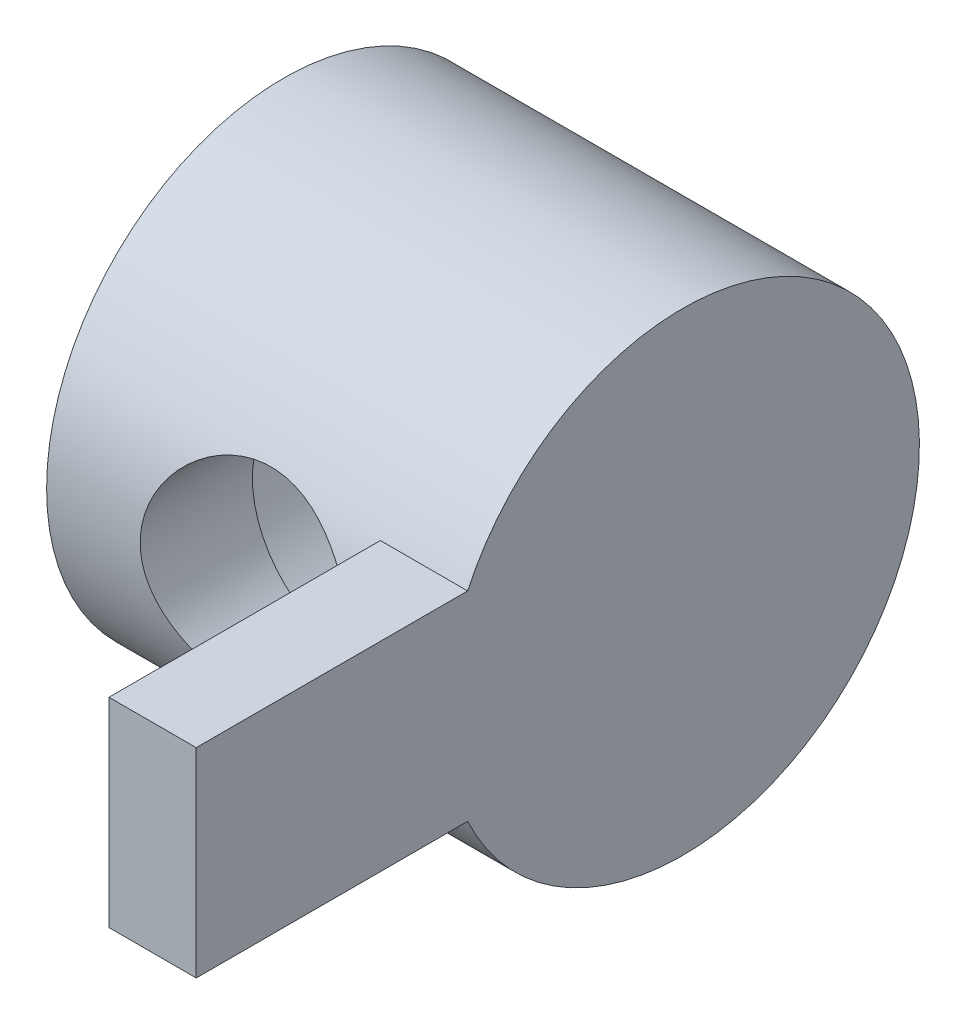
ISO-10303-21;
HEADER;
FILE_DESCRIPTION(('STEP AP214'),'2;1');
FILE_NAME('part.step','',(''),(''),'','','');
FILE_SCHEMA(('AUTOMOTIVE_DESIGN { 1 0 10303 214 1 1 1 1 }'));
ENDSEC;
DATA;
#1=APPLICATION_CONTEXT('core data for automotive mechanical design processes');
#2=APPLICATION_PROTOCOL_DEFINITION('international standard','automotive_design',2000,#1);
#3=PRODUCT_CONTEXT('',#1,'mechanical');
#4=PRODUCT('Part','Part','',(#3));
#5=PRODUCT_RELATED_PRODUCT_CATEGORY('part','',(#4));
#6=PRODUCT_DEFINITION_FORMATION('','',#4);
#7=PRODUCT_DEFINITION_CONTEXT('part definition',#1,'design');
#8=PRODUCT_DEFINITION('design','',#6,#7);
#9=PRODUCT_DEFINITION_SHAPE('','',#8);
#10=(LENGTH_UNIT() NAMED_UNIT(*) SI_UNIT(.MILLI.,.METRE.));
#11=(NAMED_UNIT(*) PLANE_ANGLE_UNIT() SI_UNIT($,.RADIAN.));
#12=(NAMED_UNIT(*) SI_UNIT($,.STERADIAN.) SOLID_ANGLE_UNIT());
#13=UNCERTAINTY_MEASURE_WITH_UNIT(LENGTH_MEASURE(1.E-05),#10,'distance_accuracy_value','');
#14=(GEOMETRIC_REPRESENTATION_CONTEXT(3) GLOBAL_UNCERTAINTY_ASSIGNED_CONTEXT((#13)) GLOBAL_UNIT_ASSIGNED_CONTEXT((#10,
#11,#12)) REPRESENTATION_CONTEXT('',''));
#15=CARTESIAN_POINT('',(0.,0.,0.));
#16=DIRECTION('',(0.,0.,1.));
#17=DIRECTION('',(1.,0.,0.));
#18=AXIS2_PLACEMENT_3D('',#15,#16,#17);
#19=CARTESIAN_POINT('',(8.,0.,-2.25));
#20=DIRECTION('',(0.,0.,1.));
#21=DIRECTION('',(-0.0627905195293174,-0.998026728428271,0.));
#22=AXIS2_PLACEMENT_3D('',#19,#20,#21);
#23=CYLINDRICAL_SURFACE('',#22,6.5);
#24=CARTESIAN_POINT('',(8.,-6.50000000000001,-6.9282032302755));
#25=CARTESIAN_POINT('',(8.04976437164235,-6.49999536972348,-6.92820700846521));
#26=CARTESIAN_POINT('',(8.09952854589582,-6.49942087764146,-6.92874653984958));
#27=CARTESIAN_POINT('',(8.1990226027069,-6.49713322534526,-6.93089203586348));
#28=CARTESIAN_POINT('',(8.24875247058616,-6.49541972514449,-6.93249831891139));
#29=CARTESIAN_POINT('',(8.34817787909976,-6.49085219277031,-6.93677497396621));
#30=CARTESIAN_POINT('',(8.39787329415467,-6.48799670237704,-6.93944670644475));
#31=CARTESIAN_POINT('',(8.49722993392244,-6.48114253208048,-6.94584866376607));
#32=CARTESIAN_POINT('',(8.54689082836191,-6.4771412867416,-6.94958126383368));
#33=CARTESIAN_POINT('',(8.64617867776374,-6.46799115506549,-6.95809812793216));
#34=CARTESIAN_POINT('',(8.69580500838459,-6.46283861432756,-6.96288574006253));
#35=CARTESIAN_POINT('',(8.79502391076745,-6.45137997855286,-6.9735039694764));
#36=CARTESIAN_POINT('',(8.84461548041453,-6.44506916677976,-6.97933884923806));
#37=CARTESIAN_POINT('',(8.94376574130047,-6.43128632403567,-6.99204151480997));
#38=CARTESIAN_POINT('',(8.9933229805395,-6.42380854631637,-6.9989144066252));
#39=CARTESIAN_POINT('',(9.09240320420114,-6.40768325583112,-7.01368057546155));
#40=CARTESIAN_POINT('',(9.14192420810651,-6.39902900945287,-7.0215797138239));
#41=CARTESIAN_POINT('',(9.29098670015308,-6.37119197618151,-7.04688217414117));
#42=CARTESIAN_POINT('',(9.38996549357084,-6.35028261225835,-7.0657534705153));
#43=CARTESIAN_POINT('',(9.58780025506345,-6.30367261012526,-7.10736959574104));
#44=CARTESIAN_POINT('',(9.68662552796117,-6.27789656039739,-7.130174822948));
#45=CARTESIAN_POINT('',(9.88417202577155,-6.2214330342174,-7.17949883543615));
#46=CARTESIAN_POINT('',(9.9828518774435,-6.1906578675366,-7.2060826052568));
#47=CARTESIAN_POINT('',(10.1801186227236,-6.1240596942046,-7.26277126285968));
#48=CARTESIAN_POINT('',(10.2786533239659,-6.08813857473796,-7.29294199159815));
#49=CARTESIAN_POINT('',(10.465723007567,-6.01495153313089,-7.35339625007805));
#50=CARTESIAN_POINT('',(10.5544433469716,-5.97800268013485,-7.38349183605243));
#51=CARTESIAN_POINT('',(10.7303298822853,-5.90016625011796,-7.44584068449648));
#52=CARTESIAN_POINT('',(10.8174772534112,-5.85924873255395,-7.47810967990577));
#53=CARTESIAN_POINT('',(10.9902243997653,-5.77336169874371,-7.54461892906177));
#54=CARTESIAN_POINT('',(11.0757991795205,-5.72835497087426,-7.57887598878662));
#55=CARTESIAN_POINT('',(11.2454072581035,-5.63416594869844,-7.6491612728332));
#56=CARTESIAN_POINT('',(11.329409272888,-5.58493963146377,-7.68520593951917));
#57=CARTESIAN_POINT('',(11.4958776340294,-5.48218451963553,-7.75884675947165));
#58=CARTESIAN_POINT('',(11.5783064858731,-5.4286054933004,-7.79645750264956));
#59=CARTESIAN_POINT('',(11.7416363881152,-5.3170169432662,-7.87299046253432));
#60=CARTESIAN_POINT('',(11.8224940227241,-5.25895166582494,-7.91192396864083));
#61=CARTESIAN_POINT('',(11.9826804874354,-5.13825465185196,-7.99084629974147));
#62=CARTESIAN_POINT('',(12.0619602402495,-5.07556223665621,-8.03084183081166));
#63=CARTESIAN_POINT('',(12.219022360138,-4.94550336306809,-8.11159436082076));
#64=CARTESIAN_POINT('',(12.2967510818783,-4.87807253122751,-8.15235194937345));
#65=CARTESIAN_POINT('',(12.445173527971,-4.74327059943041,-8.2314746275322));
#66=CARTESIAN_POINT('',(12.5160228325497,-4.67607913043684,-8.26985381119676));
#67=CARTESIAN_POINT('',(12.6543177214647,-4.53882026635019,-8.34597085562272));
#68=CARTESIAN_POINT('',(12.7217804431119,-4.46877150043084,-8.38371112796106));
#69=CARTESIAN_POINT('',(12.8533306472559,-4.32579098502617,-8.45836923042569));
#70=CARTESIAN_POINT('',(12.9174313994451,-4.25287293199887,-8.49528989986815));
#71=CARTESIAN_POINT('',(13.0422550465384,-4.10412604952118,-8.56813789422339));
#72=CARTESIAN_POINT('',(13.1029870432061,-4.02830610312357,-8.60406774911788));
#73=CARTESIAN_POINT('',(13.221078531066,-3.8737409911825,-8.67475315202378));
#74=CARTESIAN_POINT('',(13.2784425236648,-3.79499997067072,-8.70951023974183));
#75=CARTESIAN_POINT('',(13.3898049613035,-3.63458530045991,-8.7776639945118));
#76=CARTESIAN_POINT('',(13.4438029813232,-3.55291128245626,-8.81106048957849));
#77=CARTESIAN_POINT('',(13.5484283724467,-3.38662496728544,-8.87630326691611));
#78=CARTESIAN_POINT('',(13.5990501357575,-3.30200812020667,-8.90814694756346));
#79=CARTESIAN_POINT('',(13.696966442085,-3.1298630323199,-8.97008097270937));
#80=CARTESIAN_POINT('',(13.7442501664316,-3.04232656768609,-9.00016556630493));
#81=CARTESIAN_POINT('',(13.8367850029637,-2.8614870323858,-9.05931937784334));
#82=CARTESIAN_POINT('',(13.8819011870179,-2.76808985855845,-9.08831277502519));
#83=CARTESIAN_POINT('',(13.9673058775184,-2.57970640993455,-9.14355702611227));
#84=CARTESIAN_POINT('',(14.0076439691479,-2.48475079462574,-9.16983560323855));
#85=CARTESIAN_POINT('',(14.0835390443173,-2.29335017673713,-9.21955677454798));
#86=CARTESIAN_POINT('',(14.119138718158,-2.19692864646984,-9.24302446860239));
#87=CARTESIAN_POINT('',(14.1855530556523,-2.00267723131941,-9.28704059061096));
#88=CARTESIAN_POINT('',(14.2164030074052,-1.90486428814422,-9.30761044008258));
#89=CARTESIAN_POINT('',(14.2733284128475,-1.70792130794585,-9.34574798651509));
#90=CARTESIAN_POINT('',(14.2994306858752,-1.6088022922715,-9.36333250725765));
#91=CARTESIAN_POINT('',(14.3468693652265,-1.40934101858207,-9.3954204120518));
#92=CARTESIAN_POINT('',(14.368223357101,-1.30900477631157,-9.40993515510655));
#93=CARTESIAN_POINT('',(14.4061728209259,-1.10720621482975,-9.43580506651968));
#94=CARTESIAN_POINT('',(14.4227760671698,-1.00574602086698,-9.44716539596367));
#95=CARTESIAN_POINT('',(14.4512426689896,-0.801803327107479,-9.46665931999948));
#96=CARTESIAN_POINT('',(14.4631036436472,-0.69932034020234,-9.47479129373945));
#97=CARTESIAN_POINT('',(14.4725710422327,-0.596509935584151,-9.48125392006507));
#98=B_SPLINE_CURVE_WITH_KNOTS('',3,(#24,#25,#26,#27,#28,#29,#30,#31,#32,#33,#34,#35,#36,#37,#38,
#39,#40,#41,#42,#43,#44,#45,#46,#47,#48,#49,#50,#51,#52,#53,#54,#55,#56,#57,#58,#59,#60,#61,#62,
#63,#64,#65,#66,#67,#68,#69,#70,#71,#72,#73,#74,#75,#76,#77,#78,#79,#80,#81,#82,#83,#84,#85,#86,
#87,#88,#89,#90,#91,#92,#93,#94,#95,#96,#97),.UNSPECIFIED.,.F.,.F.,(4,2,2,2,2,2,2,2,2,2,2,2,2,2,
2,2,2,2,2,2,2,2,2,2,2,2,2,2,2,2,2,2,2,2,2,2,4),(0.,0.149286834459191,0.29861825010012,
0.448140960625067,0.598001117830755,0.748343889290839,0.899313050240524,1.05105059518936,
1.20369637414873,1.51222599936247,1.82600082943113,2.14603273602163,2.47327552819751,
2.7752947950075,3.07980217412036,3.38742862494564,3.69878613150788,4.01446496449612,
4.33503150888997,4.6610266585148,4.99296475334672,5.30762278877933,5.62048266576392,
5.93199684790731,6.24262367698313,6.55282542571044,6.86306626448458,7.17381018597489,
7.48551893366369,7.80847637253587,8.12771694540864,8.44385218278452,8.75751177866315,
9.06934042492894,9.37999421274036,9.69013668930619,10.0004346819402),.UNSPECIFIED.);
#99=CARTESIAN_POINT('',(8.,-6.5,-6.928203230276));
#100=VERTEX_POINT('',#99);
#101=CARTESIAN_POINT('',(14.4725710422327,-0.596509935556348,-9.48125392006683));
#102=VERTEX_POINT('',#101);
#103=EDGE_CURVE('E153',#100,#102,#98,.T.);
#104=ORIENTED_EDGE('',*,*,#103,.F.);
#105=CARTESIAN_POINT('',(1.5274289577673,-0.596509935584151,-9.48125392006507));
#106=CARTESIAN_POINT('',(1.53689492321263,-0.699304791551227,-9.47479226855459));
#107=CARTESIAN_POINT('',(1.54875456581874,-0.801772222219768,-9.46666178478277));
#108=CARTESIAN_POINT('',(1.57721870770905,-1.00568838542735,-9.44717141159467));
#109=CARTESIAN_POINT('',(1.5938210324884,-1.10713756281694,-9.43581300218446));
#110=CARTESIAN_POINT('',(1.63176885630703,-1.30891865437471,-9.40994706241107));
#111=CARTESIAN_POINT('',(1.65312233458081,-1.40924838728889,-9.39543423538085));
#112=CARTESIAN_POINT('',(1.7005601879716,-1.60870118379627,-9.36334985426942));
#113=CARTESIAN_POINT('',(1.72666234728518,-1.70781816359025,-9.34576681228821));
#114=CARTESIAN_POINT('',(1.78358775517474,-1.90476154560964,-9.30763148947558));
#115=CARTESIAN_POINT('',(1.81443801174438,-2.00257684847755,-9.28706226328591));
#116=CARTESIAN_POINT('',(1.88085312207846,-2.19683740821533,-9.24304622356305));
#117=CARTESIAN_POINT('',(1.91645343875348,-2.29326563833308,-9.21957787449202));
#118=CARTESIAN_POINT('',(1.99235027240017,-2.48468383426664,-9.16985386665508));
#119=CARTESIAN_POINT('',(2.03268964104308,-2.57965023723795,-9.14357300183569));
#120=CARTESIAN_POINT('',(2.11809626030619,-2.7680598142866,-9.0883220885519));
#121=CARTESIAN_POINT('',(2.16321322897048,-2.86147224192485,-9.05932421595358));
#122=CARTESIAN_POINT('',(2.25573095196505,-3.04230060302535,-9.00017405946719));
#123=CARTESIAN_POINT('',(2.30299504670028,-3.12981183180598,-8.97009855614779));
#124=CARTESIAN_POINT('',(2.40087811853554,-3.30191401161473,-8.90818163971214));
#125=CARTESIAN_POINT('',(2.45148657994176,-3.38651295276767,-8.87634580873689));
#126=CARTESIAN_POINT('',(2.55609028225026,-3.55277135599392,-8.8111167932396));
#127=CARTESIAN_POINT('',(2.61008022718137,-3.63443511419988,-8.77772606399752));
#128=CARTESIAN_POINT('',(2.72143171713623,-3.79483681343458,-8.70958129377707));
#129=CARTESIAN_POINT('',(2.7787931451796,-3.87357485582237,-8.67482730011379));
#130=CARTESIAN_POINT('',(2.89688465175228,-4.02814134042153,-8.60414492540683));
#131=CARTESIAN_POINT('',(2.95761953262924,-4.10396536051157,-8.56821490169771));
#132=CARTESIAN_POINT('',(3.08245405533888,-4.25272750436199,-8.49536281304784));
#133=CARTESIAN_POINT('',(3.14656308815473,-4.32565646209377,-8.45843813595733));
#134=CARTESIAN_POINT('',(3.2781352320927,-4.46866541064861,-8.38376786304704));
#135=CARTESIAN_POINT('',(3.34561188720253,-4.53873142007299,-8.34601936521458));
#136=CARTESIAN_POINT('',(3.48393905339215,-4.67603190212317,-8.26988076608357));
#137=CARTESIAN_POINT('',(3.55480695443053,-4.74324746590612,-8.23148820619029));
#138=CARTESIAN_POINT('',(3.70322241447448,-4.8780541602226,-8.15236273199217));
#139=CARTESIAN_POINT('',(3.78092376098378,-4.94546774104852,-8.11161587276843));
#140=CARTESIAN_POINT('',(3.93793941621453,-5.07549720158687,-8.03088280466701));
#141=CARTESIAN_POINT('',(4.01720029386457,-5.13817717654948,-7.99089598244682));
#142=CARTESIAN_POINT('',(4.17735621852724,-5.25885505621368,-7.91198810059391));
#143=CARTESIAN_POINT('',(4.25820243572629,-5.31691332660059,-7.87306035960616));
#144=CARTESIAN_POINT('',(4.42151697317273,-5.42849316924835,-7.79653568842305));
#145=CARTESIAN_POINT('',(4.5039421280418,-5.48207017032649,-7.75892752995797));
#146=CARTESIAN_POINT('',(4.67041050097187,-5.58482637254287,-7.68528826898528));
#147=CARTESIAN_POINT('',(4.75441647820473,-5.63405546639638,-7.64924267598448));
#148=CARTESIAN_POINT('',(4.92403985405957,-5.72825505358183,-7.5789515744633));
#149=CARTESIAN_POINT('',(5.00962621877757,-5.77326922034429,-7.54468975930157));
#150=CARTESIAN_POINT('',(5.1824040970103,-5.85917569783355,-7.47816701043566));
#151=CARTESIAN_POINT('',(5.2695708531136,-5.90010486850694,-7.44588943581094));
#152=CARTESIAN_POINT('',(5.44550304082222,-5.97797004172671,-7.38351839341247));
#153=CARTESIAN_POINT('',(5.53424987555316,-6.01493562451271,-7.3534093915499));
#154=CARTESIAN_POINT('',(5.72133094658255,-6.08813816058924,-7.29294233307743));
#155=CARTESIAN_POINT('',(5.81984948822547,-6.12405988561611,-7.26277109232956));
#156=CARTESIAN_POINT('',(6.01708894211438,-6.1906585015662,-7.20608207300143));
#157=CARTESIAN_POINT('',(6.1157577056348,-6.22143340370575,-7.17949851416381));
#158=CARTESIAN_POINT('',(6.31328632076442,-6.27789677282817,-7.13017463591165));
#159=CARTESIAN_POINT('',(6.41210486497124,-6.3036727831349,-7.10736943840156));
#160=CARTESIAN_POINT('',(6.60993064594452,-6.35028280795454,-7.06575329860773));
#161=CARTESIAN_POINT('',(6.70890725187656,-6.37119207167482,-7.04688208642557));
#162=CARTESIAN_POINT('',(6.85796817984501,-6.39902881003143,-7.02157989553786));
#163=CARTESIAN_POINT('',(6.90748975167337,-6.40768304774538,-7.01368076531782));
#164=CARTESIAN_POINT('',(7.00657223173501,-6.42380834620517,-6.99891459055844));
#165=CARTESIAN_POINT('',(7.0561311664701,-6.43128611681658,-6.99204170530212));
#166=CARTESIAN_POINT('',(7.15528593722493,-6.44506897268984,-6.9793390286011));
#167=CARTESIAN_POINT('',(7.20488032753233,-6.45137978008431,-6.97350415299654));
#168=CARTESIAN_POINT('',(7.30410599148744,-6.46283843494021,-6.96288590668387));
#169=CARTESIAN_POINT('',(7.35373626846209,-6.46799097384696,-6.9580982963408));
#170=CARTESIAN_POINT('',(7.4530331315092,-6.47714113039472,-6.94958140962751));
#171=CARTESIAN_POINT('',(7.50269909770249,-6.48114237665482,-6.94584880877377));
#172=CARTESIAN_POINT('',(7.60206700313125,-6.48799657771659,-6.93944682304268));
#173=CARTESIAN_POINT('',(7.65176861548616,-6.49085207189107,-6.9367750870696));
#174=CARTESIAN_POINT('',(7.75120754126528,-6.49541964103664,-6.9324983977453));
#175=CARTESIAN_POINT('',(7.80094473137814,-6.49713314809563,-6.93089210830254));
#176=CARTESIAN_POINT('',(7.90045455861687,-6.49942084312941,-6.92874657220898));
#177=CARTESIAN_POINT('',(7.95022718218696,-6.49999534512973,-6.92820703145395));
#178=CARTESIAN_POINT('',(8.,-6.50000000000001,-6.9282032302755));
#179=B_SPLINE_CURVE_WITH_KNOTS('',3,(#105,#106,#107,#108,#109,#110,#111,#112,#113,#114,#115,
#116,#117,#118,#119,#120,#121,#122,#123,#124,#125,#126,#127,#128,#129,#130,#131,#132,#133,#134,
#135,#136,#137,#138,#139,#140,#141,#142,#143,#144,#145,#146,#147,#148,#149,#150,#151,#152,#153,
#154,#155,#156,#157,#158,#159,#160,#161,#162,#163,#164,#165,#166,#167,#168,#169,#170,#171,#172,
#173,#174,#175,#176,#177,#178),.UNSPECIFIED.,.F.,.F.,(4,2,2,2,2,2,2,2,2,2,2,2,2,2,2,2,2,2,2,2,2,
2,2,2,2,2,2,2,2,2,2,2,2,2,2,2,4),(0.,0.31025101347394,0.620360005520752,0.930993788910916,
1.24281580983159,1.55648197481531,1.87263671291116,2.19190938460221,2.51491112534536,
2.82652141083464,3.13719466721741,3.44739296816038,3.75758051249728,4.06822154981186,
4.37977830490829,4.69270894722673,5.00746564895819,5.33930266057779,5.66522528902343,
5.9857481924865,6.30141245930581,6.61278452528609,6.92045454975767,7.22503422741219,
7.52715403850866,7.85435402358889,8.17435462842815,8.48811028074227,8.79663339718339,
8.94928082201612,9.1010233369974,9.25200082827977,9.40235531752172,9.55223059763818,
9.70177184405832,9.85112520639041,10.0004373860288),.UNSPECIFIED.);
#180=CARTESIAN_POINT('',(1.5274289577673,-0.596509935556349,-9.48125392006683));
#181=VERTEX_POINT('',#180);
#182=EDGE_CURVE('E276',#181,#100,#179,.T.);
#183=ORIENTED_EDGE('',*,*,#182,.F.);
#184=CARTESIAN_POINT('',(8.40813837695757,6.4871737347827,-6.94021447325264));
#185=CARTESIAN_POINT('',(8.35012336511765,6.49082469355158,-6.93680080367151));
#186=CARTESIAN_POINT('',(8.2920168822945,6.49370259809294,-6.93410635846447));
#187=CARTESIAN_POINT('',(8.1758401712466,6.49789850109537,-6.93017511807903));
#188=CARTESIAN_POINT('',(8.11777019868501,6.49922027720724,-6.92893479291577));
#189=CARTESIAN_POINT('',(8.00166642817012,6.50030736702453,-6.92791481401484));
#190=CARTESIAN_POINT('',(7.94363266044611,6.50007438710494,-6.92813355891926));
#191=CARTESIAN_POINT('',(7.82760162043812,6.49805390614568,-6.930028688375));
#192=CARTESIAN_POINT('',(7.76960436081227,6.49626601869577,-6.93170543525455));
#193=CARTESIAN_POINT('',(7.65364628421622,6.49113436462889,-6.93651115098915));
#194=CARTESIAN_POINT('',(7.59568567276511,6.48778812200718,-6.93964243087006));
#195=CARTESIAN_POINT('',(7.47980067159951,6.47953556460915,-6.94734847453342));
#196=CARTESIAN_POINT('',(7.42187688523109,6.47462470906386,-6.95192743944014));
#197=CARTESIAN_POINT('',(7.30606509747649,6.46323577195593,-6.96251707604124));
#198=CARTESIAN_POINT('',(7.24817829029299,6.45675113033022,-6.96853373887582));
#199=CARTESIAN_POINT('',(7.13243983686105,6.44220455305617,-6.98198389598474));
#200=CARTESIAN_POINT('',(7.07459015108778,6.4341341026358,-6.98942503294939));
#201=CARTESIAN_POINT('',(6.95892514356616,6.41640294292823,-7.00570617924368));
#202=CARTESIAN_POINT('',(6.90111270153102,6.40673184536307,-7.01455531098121));
#203=CARTESIAN_POINT('',(6.78552123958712,6.38578356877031,-7.0336313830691));
#204=CARTESIAN_POINT('',(6.72774614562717,6.37449422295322,-7.04386872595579));
#205=CARTESIAN_POINT('',(6.6122283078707,6.35029083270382,-7.06569701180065));
#206=CARTESIAN_POINT('',(6.55449063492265,6.33736294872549,-7.07729941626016));
#207=CARTESIAN_POINT('',(6.43904651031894,6.30986110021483,-7.10183045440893));
#208=CARTESIAN_POINT('',(6.38134634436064,6.29527173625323,-7.11477137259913));
#209=CARTESIAN_POINT('',(6.26597590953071,6.26442301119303,-7.14194872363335));
#210=CARTESIAN_POINT('',(6.2083131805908,6.24814680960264,-7.15619801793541));
#211=CARTESIAN_POINT('',(6.09301676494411,6.21389750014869,-7.18595843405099));
#212=CARTESIAN_POINT('',(6.03539189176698,6.19590622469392,-7.20148275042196));
#213=CARTESIAN_POINT('',(5.92016841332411,6.15819909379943,-7.23375475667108));
#214=CARTESIAN_POINT('',(5.86257985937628,6.13846388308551,-7.25051571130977));
#215=CARTESIAN_POINT('',(5.74743353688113,6.09723253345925,-7.28522415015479));
#216=CARTESIAN_POINT('',(5.68988712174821,6.07571588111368,-7.30318479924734));
#217=CARTESIAN_POINT('',(5.52812573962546,6.01273397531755,-7.35525843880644));
#218=CARTESIAN_POINT('',(5.42489490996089,5.96955851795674,-7.39038371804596));
#219=CARTESIAN_POINT('',(5.22090102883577,5.87813092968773,-7.46331127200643));
#220=CARTESIAN_POINT('',(5.12015546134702,5.82985118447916,-7.50112770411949));
#221=CARTESIAN_POINT('',(4.92112350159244,5.72803039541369,-7.57916982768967));
#222=CARTESIAN_POINT('',(4.82286483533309,5.67444860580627,-7.61941307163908));
#223=CARTESIAN_POINT('',(4.62879606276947,5.56184832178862,-7.70199782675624));
#224=CARTESIAN_POINT('',(4.53302449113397,5.50277677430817,-7.74435747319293));
#225=CARTESIAN_POINT('',(4.34391931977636,5.3790117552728,-7.83083688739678));
#226=CARTESIAN_POINT('',(4.25063520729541,5.31425386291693,-7.87497258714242));
#227=CARTESIAN_POINT('',(4.06649353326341,5.17893067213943,-7.96463220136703));
#228=CARTESIAN_POINT('',(3.97569612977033,5.10829082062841,-8.01016703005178));
#229=CARTESIAN_POINT('',(3.79651965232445,4.96101666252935,-8.10222103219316));
#230=CARTESIAN_POINT('',(3.70821083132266,4.88429900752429,-8.14874347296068));
#231=CARTESIAN_POINT('',(3.53399327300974,4.72469667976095,-8.24232741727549));
#232=CARTESIAN_POINT('',(3.44816378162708,4.64172154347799,-8.28938198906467));
#233=CARTESIAN_POINT('',(3.28190726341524,4.47243753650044,-8.38191388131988));
#234=CARTESIAN_POINT('',(3.20141937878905,4.38619557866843,-8.4274042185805));
#235=CARTESIAN_POINT('',(3.04594748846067,4.21040954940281,-8.51657354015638));
#236=CARTESIAN_POINT('',(2.97090281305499,4.12092754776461,-8.5602688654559));
#237=CARTESIAN_POINT('',(2.82630451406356,3.93868154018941,-8.6456226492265));
#238=CARTESIAN_POINT('',(2.7566957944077,3.8459698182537,-8.68729926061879));
#239=CARTESIAN_POINT('',(2.62296574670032,3.65728678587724,-8.76839154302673));
#240=CARTESIAN_POINT('',(2.55879632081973,3.56135757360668,-8.80782572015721));
#241=CARTESIAN_POINT('',(2.43593656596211,3.36627579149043,-8.88420346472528));
#242=CARTESIAN_POINT('',(2.37720670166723,3.26715494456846,-8.92116435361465));
#243=CARTESIAN_POINT('',(2.26521799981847,3.06574129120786,-8.99236197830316));
#244=CARTESIAN_POINT('',(2.21192959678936,2.96347004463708,-9.026613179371));
#245=CARTESIAN_POINT('',(2.11081046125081,2.75580800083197,-9.0921577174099));
#246=CARTESIAN_POINT('',(2.06296138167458,2.65042929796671,-9.1234609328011));
#247=CARTESIAN_POINT('',(1.9952653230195,2.49006847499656,-9.16802243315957));
#248=CARTESIAN_POINT('',(1.97338996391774,2.43626154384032,-9.18247043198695));
#249=CARTESIAN_POINT('',(1.93099884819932,2.32789822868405,-9.21053861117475));
#250=CARTESIAN_POINT('',(1.91048311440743,2.2733418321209,-9.22415877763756));
#251=CARTESIAN_POINT('',(1.87012098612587,2.16160313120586,-9.25099391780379));
#252=CARTESIAN_POINT('',(1.85032326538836,2.10439581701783,-9.26417795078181));
#253=CARTESIAN_POINT('',(1.81236745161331,1.9896912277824,-9.28948614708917));
#254=CARTESIAN_POINT('',(1.79419843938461,1.93219912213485,-9.3016173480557));
#255=CARTESIAN_POINT('',(1.7595014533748,1.81694436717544,-9.32481342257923));
#256=CARTESIAN_POINT('',(1.7429632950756,1.75918611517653,-9.33588489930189));
#257=CARTESIAN_POINT('',(1.71152668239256,1.6434193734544,-9.35695533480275));
#258=CARTESIAN_POINT('',(1.69661887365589,1.58541453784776,-9.36696040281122));
#259=CARTESIAN_POINT('',(1.66844225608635,1.4691748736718,-9.38589227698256));
#260=CARTESIAN_POINT('',(1.65516499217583,1.4109430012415,-9.39482463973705));
#261=CARTESIAN_POINT('',(1.63024850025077,1.29426967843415,-9.41160576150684));
#262=CARTESIAN_POINT('',(1.61860178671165,1.23583053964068,-9.41945946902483));
#263=CARTESIAN_POINT('',(1.59694541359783,1.11876318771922,-9.43407835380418));
#264=CARTESIAN_POINT('',(1.58692930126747,1.06013670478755,-9.44084781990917));
#265=CARTESIAN_POINT('',(1.56853307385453,0.942715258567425,-9.45329370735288));
#266=CARTESIAN_POINT('',(1.56014759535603,0.883921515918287,-9.45897371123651));
#267=CARTESIAN_POINT('',(1.5450115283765,0.766186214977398,-9.46923657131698));
#268=CARTESIAN_POINT('',(1.53825671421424,0.707245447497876,-9.47382226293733));
#269=CARTESIAN_POINT('',(1.52638082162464,0.589236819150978,-9.48189280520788));
#270=CARTESIAN_POINT('',(1.5212566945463,0.530169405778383,-9.48537970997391));
#271=CARTESIAN_POINT('',(1.51264098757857,0.411928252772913,-9.49124939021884));
#272=CARTESIAN_POINT('',(1.50914756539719,0.352754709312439,-9.49363341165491));
#273=CARTESIAN_POINT('',(1.50379204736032,0.234322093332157,-9.4972944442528));
#274=CARTESIAN_POINT('',(1.50192933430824,0.175063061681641,-9.49857187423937));
#275=CARTESIAN_POINT('',(1.49983402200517,0.0564802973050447,-9.5000172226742));
#276=CARTESIAN_POINT('',(1.49960203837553,-0.00284345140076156,-9.50018472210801));
#277=CARTESIAN_POINT('',(1.50076688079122,-0.121534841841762,-9.49940816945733));
#278=CARTESIAN_POINT('',(1.50216555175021,-0.180902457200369,-9.4984628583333));
#279=CARTESIAN_POINT('',(1.50659073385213,-0.299660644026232,-9.49545877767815));
#280=CARTESIAN_POINT('',(1.50962030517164,-0.359051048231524,-9.49339791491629));
#281=CARTESIAN_POINT('',(1.51730511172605,-0.477834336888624,-9.48816216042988));
#282=CARTESIAN_POINT('',(1.52196459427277,-0.537226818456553,-9.48498435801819));
#283=CARTESIAN_POINT('',(1.5274289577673,-0.596509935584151,-9.48125392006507));
#284=B_SPLINE_CURVE_WITH_KNOTS('',3,(#184,#185,#186,#187,#188,#189,#190,#191,#192,#193,#194,
#195,#196,#197,#198,#199,#200,#201,#202,#203,#204,#205,#206,#207,#208,#209,#210,#211,#212,#213,
#214,#215,#216,#217,#218,#219,#220,#221,#222,#223,#224,#225,#226,#227,#228,#229,#230,#231,#232,
#233,#234,#235,#236,#237,#238,#239,#240,#241,#242,#243,#244,#245,#246,#247,#248,#249,#250,#251,
#252,#253,#254,#255,#256,#257,#258,#259,#260,#261,#262,#263,#264,#265,#266,#267,#268,#269,#270,
#271,#272,#273,#274,#275,#276,#277,#278,#279,#280,#281,#282,#283),.UNSPECIFIED.,.F.,.F.,(4,2,2,
2,2,2,2,2,2,2,2,2,2,2,2,2,2,2,2,2,2,2,2,2,2,2,2,2,2,2,2,2,2,2,2,2,2,2,2,2,2,2,2,2,2,2,2,2,2,4),
(0.,0.174680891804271,0.348936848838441,0.523001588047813,0.697109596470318,0.871495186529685,
1.04639155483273,1.22202986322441,1.39863835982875,1.57644155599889,1.75565947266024,
1.93650696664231,2.11919314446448,2.30392086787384,2.49088635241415,2.68027885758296,
2.87228046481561,3.22393881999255,3.57760776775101,3.93424415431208,4.29478117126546,
4.66012208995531,5.03113506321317,5.40864907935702,5.7934510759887,6.17259802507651,
6.5465076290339,6.91592931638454,7.28164010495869,7.64444085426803,8.00515180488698,
8.36460750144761,8.54414722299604,8.72368995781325,8.90952649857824,9.09400575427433,
9.27724831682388,9.45937723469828,9.64051782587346,9.8207974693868,10.0003453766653,
10.1792923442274,10.3577704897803,10.5359129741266,10.7138537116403,10.8917270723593,
11.0696675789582,11.2478096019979,11.4262870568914,11.6052331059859),.UNSPECIFIED.);
#285=CARTESIAN_POINT('',(8.40813837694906,6.48717373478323,-6.94021447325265));
#286=VERTEX_POINT('',#285);
#287=EDGE_CURVE('E234',#286,#181,#284,.T.);
#288=ORIENTED_EDGE('',*,*,#287,.F.);
#289=DIRECTION('',(0.,0.,1.));
#290=VECTOR('',#289,1.);
#291=CARTESIAN_POINT('',(8.40813837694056,6.48717373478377,-2.25));
#292=LINE('',#291,#290);
#293=CARTESIAN_POINT('',(8.40813837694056,6.48717373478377,5.));
#294=VERTEX_POINT('',#293);
#295=EDGE_CURVE('E10',#286,#294,#292,.T.);
#296=ORIENTED_EDGE('',*,*,#295,.T.);
#297=CARTESIAN_POINT('',(8.,0.,5.));
#298=DIRECTION('',(0.,0.,-1.));
#299=DIRECTION('',(0.,1.,0.));
#300=AXIS2_PLACEMENT_3D('',#297,#298,#299);
#301=CIRCLE('',#300,6.5);
#302=CARTESIAN_POINT('',(8.,-6.5,5.));
#303=VERTEX_POINT('',#302);
#304=EDGE_CURVE('E177',#303,#294,#301,.T.);
#305=ORIENTED_EDGE('',*,*,#304,.F.);
#306=CARTESIAN_POINT('',(8.,0.,5.));
#307=DIRECTION('',(0.,0.,-1.));
#308=DIRECTION('',(0.,1.,0.));
#309=AXIS2_PLACEMENT_3D('',#306,#307,#308);
#310=CIRCLE('',#309,6.5);
#311=EDGE_CURVE('E27',#294,#303,#310,.T.);
#312=ORIENTED_EDGE('',*,*,#311,.F.);
#313=ORIENTED_EDGE('',*,*,#295,.F.);
#314=CARTESIAN_POINT('',(14.4725710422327,-0.596509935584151,-9.48125392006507));
#315=CARTESIAN_POINT('',(14.4776235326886,-0.541693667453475,-9.48470315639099));
#316=CARTESIAN_POINT('',(14.4819822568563,-0.486783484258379,-9.48768007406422));
#317=CARTESIAN_POINT('',(14.4892952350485,-0.376935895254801,-9.49267790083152));
#318=CARTESIAN_POINT('',(14.4922522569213,-0.321998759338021,-9.49470069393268));
#319=CARTESIAN_POINT('',(14.4967619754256,-0.21211380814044,-9.49779055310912));
#320=CARTESIAN_POINT('',(14.4983165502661,-0.157166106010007,-9.49885889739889));
#321=CARTESIAN_POINT('',(14.5000224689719,-0.0472767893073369,-9.50004115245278));
#322=CARTESIAN_POINT('',(14.5001747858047,0.00766480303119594,-9.50015572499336));
#323=CARTESIAN_POINT('',(14.4990770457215,0.117525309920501,-9.49943183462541));
#324=CARTESIAN_POINT('',(14.4978270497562,0.172444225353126,-9.4985934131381));
#325=CARTESIAN_POINT('',(14.4939256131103,0.282242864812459,-9.49596527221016));
#326=CARTESIAN_POINT('',(14.4912733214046,0.337122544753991,-9.49417497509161));
#327=CARTESIAN_POINT('',(14.4845681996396,0.446826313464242,-9.48964508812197));
#328=CARTESIAN_POINT('',(14.4805136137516,0.501650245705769,-9.48690430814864));
#329=CARTESIAN_POINT('',(14.4710048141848,0.611226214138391,-9.48047574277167));
#330=CARTESIAN_POINT('',(14.4655479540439,0.665977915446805,-9.4767861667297));
#331=CARTESIAN_POINT('',(14.4532354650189,0.77539327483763,-9.4684625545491));
#332=CARTESIAN_POINT('',(14.4463763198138,0.830056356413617,-9.46382614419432));
#333=CARTESIAN_POINT('',(14.4312602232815,0.939278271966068,-9.45361171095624));
#334=CARTESIAN_POINT('',(14.4229989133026,0.993836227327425,-9.44803075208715));
#335=CARTESIAN_POINT('',(14.4050789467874,1.10283244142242,-9.43593018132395));
#336=CARTESIAN_POINT('',(14.395415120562,1.15726946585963,-9.42940709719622));
#337=CARTESIAN_POINT('',(14.3746923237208,1.26600608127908,-9.41542603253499));
#338=CARTESIAN_POINT('',(14.3636274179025,1.32030402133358,-9.40796407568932));
#339=CARTESIAN_POINT('',(14.3282411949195,1.48340291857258,-9.38411678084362));
#340=CARTESIAN_POINT('',(14.3018667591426,1.59156841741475,-9.36636359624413));
#341=CARTESIAN_POINT('',(14.2435943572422,1.80717552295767,-9.32717917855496));
#342=CARTESIAN_POINT('',(14.2116328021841,1.91459211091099,-9.30570563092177));
#343=CARTESIAN_POINT('',(14.1435700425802,2.12396981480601,-9.26012393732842));
#344=CARTESIAN_POINT('',(14.107614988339,2.22599890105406,-9.23610974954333));
#345=CARTESIAN_POINT('',(14.0307246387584,2.42785633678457,-9.18511799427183));
#346=CARTESIAN_POINT('',(13.9897715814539,2.52767525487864,-9.15812989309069));
#347=CARTESIAN_POINT('',(13.9029251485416,2.72505741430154,-9.10135530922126));
#348=CARTESIAN_POINT('',(13.8570045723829,2.82260427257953,-9.07155354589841));
#349=CARTESIAN_POINT('',(13.7602245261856,3.01538554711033,-9.00931688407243));
#350=CARTESIAN_POINT('',(13.7093291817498,3.11059585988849,-8.97686318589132));
#351=CARTESIAN_POINT('',(13.6026097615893,3.29865942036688,-8.90948489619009));
#352=CARTESIAN_POINT('',(13.5467422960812,3.39148045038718,-8.87453921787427));
#353=CARTESIAN_POINT('',(13.4300865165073,3.57472965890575,-8.80233601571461));
#354=CARTESIAN_POINT('',(13.3692484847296,3.66511739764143,-8.76505631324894));
#355=CARTESIAN_POINT('',(13.2426528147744,3.84346839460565,-8.68834281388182));
#356=CARTESIAN_POINT('',(13.1768402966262,3.93138310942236,-8.64888688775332));
#357=CARTESIAN_POINT('',(13.0403188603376,4.10477921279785,-8.5679681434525));
#358=CARTESIAN_POINT('',(12.9695514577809,4.19020458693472,-8.52648414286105));
#359=CARTESIAN_POINT('',(12.8262126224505,4.35492989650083,-8.44350947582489));
#360=CARTESIAN_POINT('',(12.7537420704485,4.43433309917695,-8.40204946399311));
#361=CARTESIAN_POINT('',(12.605971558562,4.58841023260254,-8.31889858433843));
#362=CARTESIAN_POINT('',(12.5307117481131,4.66312675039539,-8.27721533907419));
#363=CARTESIAN_POINT('',(12.3773878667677,4.80795110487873,-8.19393170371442));
#364=CARTESIAN_POINT('',(12.2993570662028,4.87809585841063,-8.15233426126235));
#365=CARTESIAN_POINT('',(12.1404933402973,5.01389072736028,-8.06952142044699));
#366=CARTESIAN_POINT('',(12.0596868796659,5.0795715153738,-8.0283055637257));
#367=CARTESIAN_POINT('',(11.8952795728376,5.20656209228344,-7.94653263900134));
#368=CARTESIAN_POINT('',(11.8116983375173,5.26789568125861,-7.90597310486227));
#369=CARTESIAN_POINT('',(11.641750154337,5.38632163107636,-7.82576721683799));
#370=CARTESIAN_POINT('',(11.5553961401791,5.44343046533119,-7.78611778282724));
#371=CARTESIAN_POINT('',(11.379901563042,5.55352890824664,-7.70797414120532));
#372=CARTESIAN_POINT('',(11.2907676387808,5.60652741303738,-7.66947755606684));
#373=CARTESIAN_POINT('',(11.1097479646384,5.70856692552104,-7.59383270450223));
#374=CARTESIAN_POINT('',(11.0178630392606,5.75760910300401,-7.55668404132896));
#375=CARTESIAN_POINT('',(10.8233223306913,5.85574559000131,-7.48093605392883));
#376=CARTESIAN_POINT('',(10.7204227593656,5.90447683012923,-7.44248957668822));
#377=CARTESIAN_POINT('',(10.513958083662,5.99562506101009,-7.36924822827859));
#378=CARTESIAN_POINT('',(10.4104727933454,6.03816868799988,-7.33438643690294));
#379=CARTESIAN_POINT('',(10.2028667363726,6.11720940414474,-7.26858534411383));
#380=CARTESIAN_POINT('',(10.0988120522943,6.15382052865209,-7.23757570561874));
#381=CARTESIAN_POINT('',(9.94153004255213,6.20458881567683,-7.19399508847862));
#382=CARTESIAN_POINT('',(9.88930759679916,6.22071198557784,-7.18005317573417));
#383=CARTESIAN_POINT('',(9.7847163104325,6.25153487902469,-7.15323179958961));
#384=CARTESIAN_POINT('',(9.73235306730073,6.26624615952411,-7.14034386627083));
#385=CARTESIAN_POINT('',(9.62748276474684,6.29426613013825,-7.11565595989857));
#386=CARTESIAN_POINT('',(9.57498041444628,6.30758534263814,-7.10384792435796));
#387=CARTESIAN_POINT('',(9.4698323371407,6.33284173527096,-7.0813416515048));
#388=CARTESIAN_POINT('',(9.41719047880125,6.34478832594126,-7.0706359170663));
#389=CARTESIAN_POINT('',(9.31176435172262,6.36731803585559,-7.05035384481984));
#390=CARTESIAN_POINT('',(9.25898315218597,6.3779093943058,-7.04077071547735));
#391=CARTESIAN_POINT('',(9.15327911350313,6.39774558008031,-7.02275089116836));
#392=CARTESIAN_POINT('',(9.10035860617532,6.40699741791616,-7.01430824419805));
#393=CARTESIAN_POINT('',(8.9943766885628,6.42416968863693,-6.99858405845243));
#394=CARTESIAN_POINT('',(8.94131694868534,6.43209585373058,-6.99129752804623));
#395=CARTESIAN_POINT('',(8.83505724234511,6.44663015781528,-6.97789773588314));
#396=CARTESIAN_POINT('',(8.78185837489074,6.45324270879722,-6.97178054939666));
#397=CARTESIAN_POINT('',(8.67532088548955,6.46516103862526,-6.96072979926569));
#398=CARTESIAN_POINT('',(8.62198289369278,6.47046987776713,-6.95579346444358));
#399=CARTESIAN_POINT('',(8.51516794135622,6.47979107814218,-6.94711059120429));
#400=CARTESIAN_POINT('',(8.4616912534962,6.48380512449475,-6.94336250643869));
#401=CARTESIAN_POINT('',(8.40813837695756,6.48717373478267,-6.94021447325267));
#402=B_SPLINE_CURVE_WITH_KNOTS('',3,(#314,#315,#316,#317,#318,#319,#320,#321,#322,#323,#324,
#325,#326,#327,#328,#329,#330,#331,#332,#333,#334,#335,#336,#337,#338,#339,#340,#341,#342,#343,
#344,#345,#346,#347,#348,#349,#350,#351,#352,#353,#354,#355,#356,#357,#358,#359,#360,#361,#362,
#363,#364,#365,#366,#367,#368,#369,#370,#371,#372,#373,#374,#375,#376,#377,#378,#379,#380,#381,
#382,#383,#384,#385,#386,#387,#388,#389,#390,#391,#392,#393,#394,#395,#396,#397,#398,#399,#400,
#401),.UNSPECIFIED.,.F.,.F.,(4,2,2,2,2,2,2,2,2,2,2,2,2,2,2,2,2,2,2,2,2,2,2,2,2,2,2,2,2,2,2,2,2,
2,2,2,2,2,2,2,2,2,2,4),(0.,0.165463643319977,0.33059918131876,0.495513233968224,
0.66031285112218,0.825105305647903,0.989997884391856,1.15509767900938,1.32051137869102,
1.48634506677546,1.65270402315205,1.81969253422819,1.98741371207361,2.32542281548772,
2.66756445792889,2.99982850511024,3.33330976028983,3.66871955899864,4.00675706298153,
4.34810528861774,4.69342760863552,5.04336479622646,5.39853264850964,5.74407423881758,
6.08579481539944,6.42428215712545,6.76014103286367,7.09399050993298,7.42646089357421,
7.75819036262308,8.0898213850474,8.45016337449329,8.80156754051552,9.14510537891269,
9.31429882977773,9.48196178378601,9.6482484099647,9.81331673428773,9.97732830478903,
10.1404478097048,10.3028426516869,10.4646824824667,10.6261387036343,10.7873839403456),.UNSPECIFIED.);
#403=EDGE_CURVE('E249',#102,#286,#402,.T.);
#404=ORIENTED_EDGE('',*,*,#403,.F.);
#405=EDGE_LOOP('',(#104,#183,#288,#296,#305,#312,#313,#404));
#406=FACE_BOUND('',#405,.T.);
#407=ADVANCED_FACE('F16',(#406),#23,.F.);
#408=CARTESIAN_POINT('',(1.233226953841,0.,5.));
#409=DIRECTION('',(0.,0.,-1.));
#410=DIRECTION('',(0.,-1.,0.));
#411=AXIS2_PLACEMENT_3D('',#408,#409,#410);
#412=PLANE('',#411);
#413=CARTESIAN_POINT('',(8.,0.,5.));
#414=DIRECTION('',(0.,0.,-1.));
#415=DIRECTION('',(0.,1.,0.));
#416=AXIS2_PLACEMENT_3D('',#413,#414,#415);
#417=CIRCLE('',#416,4.25);
#418=CARTESIAN_POINT('',(8.,4.25,5.));
#419=VERTEX_POINT('',#418);
#420=CARTESIAN_POINT('',(8.2668597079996,-4.24161359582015,5.));
#421=VERTEX_POINT('',#420);
#422=EDGE_CURVE('E174',#419,#421,#417,.T.);
#423=ORIENTED_EDGE('',*,*,#422,.F.);
#424=CARTESIAN_POINT('',(8.,0.,5.));
#425=DIRECTION('',(0.,0.,-1.));
#426=DIRECTION('',(0.,1.,0.));
#427=AXIS2_PLACEMENT_3D('',#424,#425,#426);
#428=CIRCLE('',#427,4.25);
#429=EDGE_CURVE('E170',#421,#419,#428,.T.);
#430=ORIENTED_EDGE('',*,*,#429,.F.);
#431=EDGE_LOOP('',(#423,#430));
#432=FACE_BOUND('',#431,.T.);
#433=ORIENTED_EDGE('',*,*,#304,.T.);
#434=ORIENTED_EDGE('',*,*,#311,.T.);
#435=EDGE_LOOP('',(#433,#434));
#436=FACE_BOUND('',#435,.T.);
#437=ADVANCED_FACE('F487',(#432,#436),#412,.T.);
#438=CARTESIAN_POINT('',(8.,0.,7.25));
#439=DIRECTION('',(0.,0.,-1.));
#440=DIRECTION('',(-0.0627905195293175,0.998026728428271,0.));
#441=AXIS2_PLACEMENT_3D('',#438,#439,#440);
#442=CYLINDRICAL_SURFACE('',#441,4.25);
#443=CARTESIAN_POINT('',(8.26682749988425,-4.24121968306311,8.5007091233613));
#444=CARTESIAN_POINT('',(8.22799023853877,-4.24375597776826,8.4994434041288));
#445=CARTESIAN_POINT('',(8.18910753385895,-4.24573250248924,8.49845613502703));
#446=CARTESIAN_POINT('',(8.11124868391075,-4.24857171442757,8.49703726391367));
#447=CARTESIAN_POINT('',(8.07227248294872,-4.24943317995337,8.49660627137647));
#448=CARTESIAN_POINT('',(7.99422671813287,-4.25004308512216,8.49630116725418));
#449=CARTESIAN_POINT('',(7.95515713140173,-4.24978916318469,8.49642823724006));
#450=CARTESIAN_POINT('',(7.87692452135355,-4.2481695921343,8.49723814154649));
#451=CARTESIAN_POINT('',(7.83776158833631,-4.24680046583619,8.4979227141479));
#452=CARTESIAN_POINT('',(7.75934222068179,-4.24295038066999,8.49984568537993));
#453=CARTESIAN_POINT('',(7.72008606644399,-4.24046486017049,8.50108635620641));
#454=CARTESIAN_POINT('',(7.64147982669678,-4.23438292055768,8.50411740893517));
#455=CARTESIAN_POINT('',(7.60213028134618,-4.23078090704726,8.50591055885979));
#456=CARTESIAN_POINT('',(7.52333783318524,-4.22245997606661,8.51004426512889));
#457=CARTESIAN_POINT('',(7.48389580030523,-4.21773444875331,8.51238806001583));
#458=CARTESIAN_POINT('',(7.40451703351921,-4.20713008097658,8.51763418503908));
#459=CARTESIAN_POINT('',(7.36458333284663,-4.20123294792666,8.52054535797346));
#460=CARTESIAN_POINT('',(7.28498078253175,-4.18836171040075,8.52687971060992));
#461=CARTESIAN_POINT('',(7.24531166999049,-4.18138892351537,8.53030226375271));
#462=CARTESIAN_POINT('',(7.16623906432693,-4.16635854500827,8.53765344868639));
#463=CARTESIAN_POINT('',(7.12683549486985,-4.15830128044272,8.54158192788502));
#464=CARTESIAN_POINT('',(7.04829359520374,-4.14109975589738,8.54993475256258));
#465=CARTESIAN_POINT('',(7.00915544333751,-4.13195482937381,8.55435940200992));
#466=CARTESIAN_POINT('',(6.93114393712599,-4.11257429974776,8.56369362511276));
#467=CARTESIAN_POINT('',(6.89227107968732,-4.10233704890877,8.56860393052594));
#468=CARTESIAN_POINT('',(6.81479071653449,-4.08076529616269,8.5788983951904));
#469=CARTESIAN_POINT('',(6.77618408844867,-4.06942818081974,8.58428368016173));
#470=CARTESIAN_POINT('',(6.69923242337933,-4.04566006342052,8.59551092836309));
#471=CARTESIAN_POINT('',(6.66088868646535,-4.03322554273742,8.60135435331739));
#472=CARTESIAN_POINT('',(6.58503720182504,-4.00741713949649,8.61340865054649));
#473=CARTESIAN_POINT('',(6.54752490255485,-3.99405453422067,8.61961500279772));
#474=CARTESIAN_POINT('',(6.47282022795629,-3.9662067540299,8.63246429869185));
#475=CARTESIAN_POINT('',(6.43562972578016,-3.95171731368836,8.6391088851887));
#476=CARTESIAN_POINT('',(6.36156412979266,-3.92161759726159,8.65281400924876));
#477=CARTESIAN_POINT('',(6.32469147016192,-3.90600218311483,8.65987642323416));
#478=CARTESIAN_POINT('',(6.25126381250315,-3.87364264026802,8.67439963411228));
#479=CARTESIAN_POINT('',(6.21471187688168,-3.85689251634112,8.68186249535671));
#480=CARTESIAN_POINT('',(6.10513668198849,-3.80475101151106,8.70490227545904));
#481=CARTESIAN_POINT('',(6.0329608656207,-3.76778035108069,8.72098752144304));
#482=CARTESIAN_POINT('',(5.92609879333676,-3.70914291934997,8.74601152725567));
#483=CARTESIAN_POINT('',(5.89050517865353,-3.68893756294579,8.75455553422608));
#484=CARTESIAN_POINT('',(5.82125550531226,-3.64833176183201,8.77155297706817));
#485=CARTESIAN_POINT('',(5.78757666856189,-3.62796663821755,8.77999792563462));
#486=CARTESIAN_POINT('',(5.68746391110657,-3.56556916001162,8.8056083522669));
#487=CARTESIAN_POINT('',(5.62191882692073,-3.52221546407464,8.82305765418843));
#488=CARTESIAN_POINT('',(5.49329578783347,-3.43197503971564,8.85854958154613));
#489=CARTESIAN_POINT('',(5.43022247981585,-3.38508210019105,8.87659321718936));
#490=CARTESIAN_POINT('',(5.30650532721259,-3.28774982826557,8.9131036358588));
#491=CARTESIAN_POINT('',(5.24587398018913,-3.23729518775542,8.93157198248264));
#492=CARTESIAN_POINT('',(5.12955177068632,-3.13484456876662,8.96803243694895));
#493=CARTESIAN_POINT('',(5.07376328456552,-3.08295776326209,8.9860196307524));
#494=CARTESIAN_POINT('',(4.96494756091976,-2.97593717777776,9.02202835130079));
#495=CARTESIAN_POINT('',(4.9119320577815,-2.92079141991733,9.04004973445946));
#496=CARTESIAN_POINT('',(4.80862497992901,-2.80724881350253,9.07595300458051));
#497=CARTESIAN_POINT('',(4.75835385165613,-2.74883279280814,9.09383316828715));
#498=CARTESIAN_POINT('',(4.68517749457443,-2.65896948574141,9.12035448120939));
#499=CARTESIAN_POINT('',(4.66108086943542,-2.62853706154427,9.12917386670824));
#500=CARTESIAN_POINT('',(4.61292398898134,-2.56602612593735,9.1469448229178));
#501=CARTESIAN_POINT('',(4.58888981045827,-2.53392614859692,9.15589152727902));
#502=CARTESIAN_POINT('',(4.51837140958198,-2.436991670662,9.18234935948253));
#503=CARTESIAN_POINT('',(4.47316401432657,-2.37114555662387,9.19959008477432));
#504=CARTESIAN_POINT('',(4.3866428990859,-2.23726148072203,9.23305988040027));
#505=CARTESIAN_POINT('',(4.34530825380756,-2.16923832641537,9.24929420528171));
#506=CARTESIAN_POINT('',(4.26649725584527,-2.03101358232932,9.28062441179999));
#507=CARTESIAN_POINT('',(4.2290095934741,-1.96081921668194,9.29572359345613));
#508=CARTESIAN_POINT('',(4.17555593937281,-1.8535608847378,9.31749216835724));
#509=CARTESIAN_POINT('',(4.15812917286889,-1.81731315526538,9.32463168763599));
#510=CARTESIAN_POINT('',(4.1243585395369,-1.74433637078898,9.33855808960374));
#511=CARTESIAN_POINT('',(4.1080126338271,-1.70760838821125,9.34534563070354));
#512=CARTESIAN_POINT('',(4.0763945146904,-1.63367988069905,9.3585521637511));
#513=CARTESIAN_POINT('',(4.06112107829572,-1.59647995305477,9.36497157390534));
#514=CARTESIAN_POINT('',(4.03164934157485,-1.52160933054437,9.37742739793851));
#515=CARTESIAN_POINT('',(4.01745064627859,-1.48393881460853,9.38346395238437));
#516=CARTESIAN_POINT('',(3.99012694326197,-1.40813099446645,9.39513908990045));
#517=CARTESIAN_POINT('',(3.97700239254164,-1.3699934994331,9.40077750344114));
#518=CARTESIAN_POINT('',(3.95182631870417,-1.29325554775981,9.41164138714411));
#519=CARTESIAN_POINT('',(3.93977611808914,-1.25465458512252,9.41686634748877));
#520=CARTESIAN_POINT('',(3.9167477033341,-1.17699363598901,9.42688823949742));
#521=CARTESIAN_POINT('',(3.90577168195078,-1.13793288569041,9.43168429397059));
#522=CARTESIAN_POINT('',(3.88489125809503,-1.05935774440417,9.4408331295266));
#523=CARTESIAN_POINT('',(3.87498991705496,-1.01984239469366,9.4451846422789));
#524=CARTESIAN_POINT('',(3.85312010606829,-0.927053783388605,9.4548094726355));
#525=CARTESIAN_POINT('',(3.84158845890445,-0.873656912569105,9.45989532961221));
#526=CARTESIAN_POINT('',(3.82588139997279,-0.793794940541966,9.46681486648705));
#527=CARTESIAN_POINT('',(3.82095684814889,-0.767502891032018,9.46898293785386));
#528=CARTESIAN_POINT('',(3.80927369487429,-0.701797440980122,9.47412469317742));
#529=CARTESIAN_POINT('',(3.80281131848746,-0.662320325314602,9.47696705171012));
#530=CARTESIAN_POINT('',(3.79100087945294,-0.583330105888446,9.48215621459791));
#531=CARTESIAN_POINT('',(3.7856484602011,-0.543817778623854,9.48450495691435));
#532=CARTESIAN_POINT('',(3.77605959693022,-0.464762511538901,9.4887068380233));
#533=CARTESIAN_POINT('',(3.77181957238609,-0.42522009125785,9.49056156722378));
#534=CARTESIAN_POINT('',(3.7644466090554,-0.346111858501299,9.49377531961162));
#535=CARTESIAN_POINT('',(3.76131092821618,-0.306546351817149,9.49513557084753));
#536=CARTESIAN_POINT('',(3.75621641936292,-0.228024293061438,9.49734280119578));
#537=CARTESIAN_POINT('',(3.75423786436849,-0.189069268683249,9.49819838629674));
#538=CARTESIAN_POINT('',(3.75140023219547,-0.11106979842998,9.49943084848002));
#539=CARTESIAN_POINT('',(3.7505423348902,-0.0720253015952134,9.49980722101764));
#540=CARTESIAN_POINT('',(3.74993728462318,0.00614674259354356,9.50007856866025));
#541=CARTESIAN_POINT('',(3.75019220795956,0.0452743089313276,9.49997264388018));
#542=CARTESIAN_POINT('',(3.7518138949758,0.123606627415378,9.49927679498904));
#543=CARTESIAN_POINT('',(3.75318362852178,0.162811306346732,9.49868557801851));
#544=CARTESIAN_POINT('',(3.75703388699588,0.241292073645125,9.4970165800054));
#545=CARTESIAN_POINT('',(3.75951824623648,0.280567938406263,9.49593711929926));
#546=CARTESIAN_POINT('',(3.76559555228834,0.359184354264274,9.4932892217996));
#547=CARTESIAN_POINT('',(3.76919316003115,0.398524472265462,9.49171872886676));
#548=CARTESIAN_POINT('',(3.77893393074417,0.490839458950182,9.48745989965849));
#549=CARTESIAN_POINT('',(3.78552734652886,0.543758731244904,9.48457269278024));
#550=CARTESIAN_POINT('',(3.79689741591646,0.623225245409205,9.47957316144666));
#551=CARTESIAN_POINT('',(3.8009645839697,0.649897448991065,9.47778171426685));
#552=CARTESIAN_POINT('',(3.81179981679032,0.716885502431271,9.4729991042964));
#553=CARTESIAN_POINT('',(3.81887883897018,0.75714171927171,9.46986578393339));
#554=CARTESIAN_POINT('',(3.83412515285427,0.837255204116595,9.46311862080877));
#555=CARTESIAN_POINT('',(3.84228843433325,0.877113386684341,9.45950654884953));
#556=CARTESIAN_POINT('',(3.85970061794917,0.956426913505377,9.45181624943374));
#557=CARTESIAN_POINT('',(3.86894636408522,0.995883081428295,9.44773937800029));
#558=CARTESIAN_POINT('',(3.88852310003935,1.07438753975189,9.43913382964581));
#559=CARTESIAN_POINT('',(3.89885179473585,1.11343650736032,9.43460610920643));
#560=CARTESIAN_POINT('',(3.92059343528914,1.19112232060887,9.42511309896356));
#561=CARTESIAN_POINT('',(3.93200495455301,1.22975963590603,9.42014838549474));
#562=CARTESIAN_POINT('',(3.9559113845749,1.30661817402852,9.40979552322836));
#563=CARTESIAN_POINT('',(3.96840573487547,1.34483960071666,9.40440759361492));
#564=CARTESIAN_POINT('',(3.99447702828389,1.42086276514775,9.3932223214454));
#565=CARTESIAN_POINT('',(4.00805426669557,1.45866438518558,9.3874248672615));
#566=CARTESIAN_POINT('',(4.03629019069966,1.53384477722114,9.37543442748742));
#567=CARTESIAN_POINT('',(4.05095000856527,1.57122305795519,9.36924102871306));
#568=CARTESIAN_POINT('',(4.08135135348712,1.6455536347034,9.35647251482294));
#569=CARTESIAN_POINT('',(4.09709482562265,1.68250501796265,9.34989671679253));
#570=CARTESIAN_POINT('',(4.12965857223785,1.75598021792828,9.33637683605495));
#571=CARTESIAN_POINT('',(4.14648155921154,1.79250266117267,9.32943183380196));
#572=CARTESIAN_POINT('',(4.19006496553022,1.88360498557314,9.3115604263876));
#573=CARTESIAN_POINT('',(4.21749194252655,1.93782600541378,9.30042101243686));
#574=CARTESIAN_POINT('',(4.26936477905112,2.03527472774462,9.2795296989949));
#575=CARTESIAN_POINT('',(4.29345350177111,2.07871814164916,9.2698909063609));
#576=CARTESIAN_POINT('',(4.34287252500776,2.16445892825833,9.25024538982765));
#577=CARTESIAN_POINT('',(4.36819475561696,2.20676151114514,9.24024114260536));
#578=CARTESIAN_POINT('',(4.41498846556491,2.28199316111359,9.22191356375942));
#579=CARTESIAN_POINT('',(4.4362089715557,2.31509490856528,9.21365726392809));
#580=CARTESIAN_POINT('',(4.47945513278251,2.38055837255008,9.19696033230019));
#581=CARTESIAN_POINT('',(4.50147794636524,2.41292214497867,9.18852038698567));
#582=CARTESIAN_POINT('',(4.5686836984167,2.5088028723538,9.16298375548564));
#583=CARTESIAN_POINT('',(4.61515469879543,2.57135173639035,9.14561090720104));
#584=CARTESIAN_POINT('',(4.7113231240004,2.6935064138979,9.11038177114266));
#585=CARTESIAN_POINT('',(4.76101232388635,2.7531190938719,9.09252677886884));
#586=CARTESIAN_POINT('',(4.86360595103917,2.86944381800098,9.05648934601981));
#587=CARTESIAN_POINT('',(4.91651130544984,2.92615501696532,9.03830681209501));
#588=CARTESIAN_POINT('',(5.01655554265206,3.02756649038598,9.00478847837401));
#589=CARTESIAN_POINT('',(5.06323915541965,3.07272365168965,8.98946895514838));
#590=CARTESIAN_POINT('',(5.17964365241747,3.18040085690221,8.95207100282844));
#591=CARTESIAN_POINT('',(5.25043036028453,3.24177772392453,8.92999666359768));
#592=CARTESIAN_POINT('',(5.38483600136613,3.35087607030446,8.88957143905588));
#593=CARTESIAN_POINT('',(5.44790695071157,3.39925440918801,8.87116501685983));
#594=CARTESIAN_POINT('',(5.57620648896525,3.49202560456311,8.83505592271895));
#595=CARTESIAN_POINT('',(5.64141058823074,3.5364503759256,8.81734841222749));
#596=CARTESIAN_POINT('',(5.77395852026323,3.62138358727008,8.78280536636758));
#597=CARTESIAN_POINT('',(5.84128693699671,3.66191419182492,8.76596518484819));
#598=CARTESIAN_POINT('',(5.97807820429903,3.73911958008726,8.73331191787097));
#599=CARTESIAN_POINT('',(6.04753391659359,3.77580574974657,8.71749585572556));
#600=CARTESIAN_POINT('',(6.18276618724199,3.84253784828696,8.68827475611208));
#601=CARTESIAN_POINT('',(6.24837597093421,3.87288171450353,8.67477839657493));
#602=CARTESIAN_POINT('',(6.35491227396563,3.91894380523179,8.65403031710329));
#603=CARTESIAN_POINT('',(6.39532567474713,3.93569571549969,8.64642200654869));
#604=CARTESIAN_POINT('',(6.47648248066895,3.96785987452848,8.63170894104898));
#605=CARTESIAN_POINT('',(6.51722239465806,3.98327963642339,8.62460141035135));
#606=CARTESIAN_POINT('',(6.59593488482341,4.01168025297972,8.61142533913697));
#607=CARTESIAN_POINT('',(6.63386644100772,4.02475751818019,8.60531921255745));
#608=CARTESIAN_POINT('',(6.71000693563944,4.04978870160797,8.59356747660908));
#609=CARTESIAN_POINT('',(6.74821428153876,4.06174668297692,8.58792021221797));
#610=CARTESIAN_POINT('',(6.82490541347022,4.08454679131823,8.5770995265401));
#611=CARTESIAN_POINT('',(6.86338809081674,4.09539202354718,8.57192479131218));
#612=CARTESIAN_POINT('',(6.94062951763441,4.11597328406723,8.5620613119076));
#613=CARTESIAN_POINT('',(6.97938758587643,4.12571142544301,8.55737164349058));
#614=CARTESIAN_POINT('',(7.05717934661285,4.14408474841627,8.54848908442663));
#615=CARTESIAN_POINT('',(7.09621272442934,4.15272102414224,8.54429570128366));
#616=CARTESIAN_POINT('',(7.17455474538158,4.16889645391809,8.53641513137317));
#617=CARTESIAN_POINT('',(7.21386337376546,4.17643566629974,8.53272791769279));
#618=CARTESIAN_POINT('',(7.29275563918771,4.19042178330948,8.52586805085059));
#619=CARTESIAN_POINT('',(7.33233949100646,4.19686770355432,8.52269586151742));
#620=CARTESIAN_POINT('',(7.41178185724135,4.2086733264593,8.51687220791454));
#621=CARTESIAN_POINT('',(7.45164074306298,4.21403100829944,8.51422171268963));
#622=CARTESIAN_POINT('',(7.53163351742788,4.22365875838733,8.5094497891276));
#623=CARTESIAN_POINT('',(7.57176786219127,4.22792576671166,8.50732984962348));
#624=CARTESIAN_POINT('',(7.6523096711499,4.23539600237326,8.50361323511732));
#625=CARTESIAN_POINT('',(7.6927175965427,4.2385952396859,8.50201852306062));
#626=CARTESIAN_POINT('',(7.77200788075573,4.24373906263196,8.49945214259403));
#627=CARTESIAN_POINT('',(7.81088655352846,4.24572874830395,8.49845808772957));
#628=CARTESIAN_POINT('',(7.88873953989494,4.24857800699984,8.49703404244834));
#629=CARTESIAN_POINT('',(7.92771391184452,4.24943631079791,8.49660468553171));
#630=CARTESIAN_POINT('',(8.00575674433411,4.25004411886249,8.49630067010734));
#631=CARTESIAN_POINT('',(8.04482522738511,4.24979124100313,8.49642720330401));
#632=CARTESIAN_POINT('',(8.12305675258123,4.2481724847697,8.49723668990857));
#633=CARTESIAN_POINT('',(8.16221970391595,4.24680309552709,8.49792139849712));
#634=CARTESIAN_POINT('',(8.24064012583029,4.24295269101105,8.4998445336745));
#635=CARTESIAN_POINT('',(8.27989731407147,4.24046708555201,8.5010852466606));
#636=CARTESIAN_POINT('',(8.35850666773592,4.2343847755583,8.50411648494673));
#637=CARTESIAN_POINT('',(8.39785829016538,4.23078244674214,8.50590979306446));
#638=CARTESIAN_POINT('',(8.47665593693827,4.22246082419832,8.51004384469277));
#639=CARTESIAN_POINT('',(8.51610108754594,4.21773489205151,8.5123878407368));
#640=CARTESIAN_POINT('',(8.59548296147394,4.20713005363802,8.51763419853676));
#641=CARTESIAN_POINT('',(8.63541666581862,4.20123294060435,8.52054536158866));
#642=CARTESIAN_POINT('',(8.71501921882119,4.18836171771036,8.526879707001));
#643=CARTESIAN_POINT('',(8.75468833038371,4.18138892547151,8.53030226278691));
#644=CARTESIAN_POINT('',(8.8337609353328,4.16635854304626,8.53765344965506));
#645=CARTESIAN_POINT('',(8.87316450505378,4.158301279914,8.54158192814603));
#646=CARTESIAN_POINT('',(8.95170640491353,4.14109975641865,8.54993475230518));
#647=CARTESIAN_POINT('',(8.99084455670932,4.13195482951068,8.5543594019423));
#648=CARTESIAN_POINT('',(9.068856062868,4.11257429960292,8.56369362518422));
#649=CARTESIAN_POINT('',(9.10772892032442,4.10233704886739,8.56860393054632));
#650=CARTESIAN_POINT('',(9.18520928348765,4.08076529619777,8.57889839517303));
#651=CARTESIAN_POINT('',(9.22381591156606,4.06942818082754,8.58428368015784));
#652=CARTESIAN_POINT('',(9.30076757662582,4.045660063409,8.59551092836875));
#653=CARTESIAN_POINT('',(9.33911131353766,4.033225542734,8.60135435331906));
#654=CARTESIAN_POINT('',(9.41496279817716,4.00741713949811,8.61340865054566));
#655=CARTESIAN_POINT('',(9.45247509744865,3.99405453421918,8.61961500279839));
#656=CARTESIAN_POINT('',(9.52717977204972,3.9662067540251,8.63246429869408));
#657=CARTESIAN_POINT('',(9.56437027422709,3.95171731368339,8.63910888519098));
#658=CARTESIAN_POINT('',(9.63843587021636,3.92161759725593,8.65281400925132));
#659=CARTESIAN_POINT('',(9.67530852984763,3.90600218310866,8.65987642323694));
#660=CARTESIAN_POINT('',(9.74873618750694,3.87364264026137,8.67439963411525));
#661=CARTESIAN_POINT('',(9.78528812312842,3.85689251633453,8.68186249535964));
#662=CARTESIAN_POINT('',(9.89486331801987,3.80475101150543,8.70490227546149));
#663=CARTESIAN_POINT('',(9.96703913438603,3.76778035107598,8.720987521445));
#664=CARTESIAN_POINT('',(10.0739012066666,3.70914291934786,8.74601152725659));
#665=CARTESIAN_POINT('',(10.1094948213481,3.68893756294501,8.75455553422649));
#666=CARTESIAN_POINT('',(10.1787444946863,3.64833176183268,8.77155297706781));
#667=CARTESIAN_POINT('',(10.2124233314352,3.62796663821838,8.77999792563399));
#668=CARTESIAN_POINT('',(10.312536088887,3.56556916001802,8.80560835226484));
#669=CARTESIAN_POINT('',(10.3780811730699,3.52221546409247,8.82305765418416));
#670=CARTESIAN_POINT('',(10.5067042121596,3.4319750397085,8.85854958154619));
#671=CARTESIAN_POINT('',(10.5697775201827,3.38508210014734,8.87659321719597));
#672=CARTESIAN_POINT('',(10.6934946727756,3.28774982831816,8.9131036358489));
#673=CARTESIAN_POINT('',(10.7541260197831,3.23729518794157,8.93157198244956));
#674=CARTESIAN_POINT('',(10.8704482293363,3.13484456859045,8.9680324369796));
#675=CARTESIAN_POINT('',(10.9262367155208,3.08295776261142,8.98601963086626));
#676=CARTESIAN_POINT('',(11.0350524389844,2.97593717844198,9.02202835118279));
#677=CARTESIAN_POINT('',(11.0880679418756,2.92079142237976,9.04004973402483));
#678=CARTESIAN_POINT('',(11.1913750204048,2.80724881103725,9.07595300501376));
#679=CARTESIAN_POINT('',(11.2416461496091,2.74883278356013,9.09383316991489));
#680=CARTESIAN_POINT('',(11.3148225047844,2.65896949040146,9.12035448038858));
#681=CARTESIAN_POINT('',(11.3389191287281,2.62853707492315,9.1291738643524));
#682=CARTESIAN_POINT('',(11.3870760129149,2.5660261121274,9.14694482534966));
#683=CARTESIAN_POINT('',(11.411110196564,2.53392609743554,9.15589153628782));
#684=CARTESIAN_POINT('',(11.4816285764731,2.43699177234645,9.18234934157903));
#685=CARTESIAN_POINT('',(11.5268359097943,2.3711461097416,9.19958998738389));
#686=CARTESIAN_POINT('',(11.6133571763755,2.23726093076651,9.23305997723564));
#687=CARTESIAN_POINT('',(11.6546920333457,2.16923623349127,9.24929457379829));
#688=CARTESIAN_POINT('',(11.7335024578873,2.03101566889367,9.28062404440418));
#689=CARTESIAN_POINT('',(11.770989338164,1.96082700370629,9.29572222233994));
#690=CARTESIAN_POINT('',(11.8423138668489,1.81769823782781,9.32477044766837));
#691=CARTESIAN_POINT('',(11.8761220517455,1.74474145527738,9.33871103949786));
#692=CARTESIAN_POINT('',(11.9235951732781,1.63389189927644,9.35851486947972));
#693=CARTESIAN_POINT('',(11.9388560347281,1.5967718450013,9.36492148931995));
#694=CARTESIAN_POINT('',(11.9682968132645,1.52209876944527,9.37734747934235));
#695=CARTESIAN_POINT('',(11.9824781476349,1.48454639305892,9.38336735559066));
#696=CARTESIAN_POINT('',(12.0097578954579,1.40901301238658,9.39500621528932));
#697=CARTESIAN_POINT('',(12.0228569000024,1.3710322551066,9.40062541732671));
#698=CARTESIAN_POINT('',(12.0479735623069,1.29464600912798,9.41144941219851));
#699=CARTESIAN_POINT('',(12.0599909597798,1.25624042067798,9.41665410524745));
#700=CARTESIAN_POINT('',(12.0829450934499,1.1790088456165,9.42663544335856));
#701=CARTESIAN_POINT('',(12.0938807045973,1.14018246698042,9.43141164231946));
#702=CARTESIAN_POINT('',(12.1146720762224,1.06211389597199,9.44052230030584));
#703=CARTESIAN_POINT('',(12.1245258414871,1.02287107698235,9.44485594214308));
#704=CARTESIAN_POINT('',(12.1431547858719,0.943974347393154,9.45306772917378));
#705=CARTESIAN_POINT('',(12.151927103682,0.904319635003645,9.45694466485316));
#706=CARTESIAN_POINT('',(12.1683924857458,0.824604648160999,9.46422921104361));
#707=CARTESIAN_POINT('',(12.1760818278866,0.784543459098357,9.46763520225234));
#708=CARTESIAN_POINT('',(12.1919469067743,0.695243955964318,9.47465371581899));
#709=CARTESIAN_POINT('',(12.1998501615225,0.645947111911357,9.47814355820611));
#710=CARTESIAN_POINT('',(12.2113439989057,0.565623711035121,9.48319714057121));
#711=CARTESIAN_POINT('',(12.2154400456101,0.5346827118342,9.48499224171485));
#712=CARTESIAN_POINT('',(12.2239780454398,0.464286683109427,9.48872987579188));
#713=CARTESIAN_POINT('',(12.2282119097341,0.424801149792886,9.49058008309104));
#714=CARTESIAN_POINT('',(12.2355682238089,0.345870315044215,9.49378362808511));
#715=CARTESIAN_POINT('',(12.2386951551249,0.306425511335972,9.49513897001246));
#716=CARTESIAN_POINT('',(12.2437913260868,0.227931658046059,9.49734540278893));
#717=CARTESIAN_POINT('',(12.2457742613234,0.188883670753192,9.49820245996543));
#718=CARTESIAN_POINT('',(12.2486191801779,0.11071654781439,9.49943528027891));
#719=CARTESIAN_POINT('',(12.2494805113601,0.0715973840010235,9.4998107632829));
#720=CARTESIAN_POINT('',(12.2500889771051,-0.00670582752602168,9.50007842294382));
#721=CARTESIAN_POINT('',(12.2498345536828,-0.045889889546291,9.49996992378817));
#722=CARTESIAN_POINT('',(12.2482108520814,-0.124316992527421,9.49926768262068));
#723=CARTESIAN_POINT('',(12.2468391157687,-0.163559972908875,9.49867287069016));
#724=CARTESIAN_POINT('',(12.2429821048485,-0.242098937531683,9.49699613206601));
#725=CARTESIAN_POINT('',(12.2404934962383,-0.281394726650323,9.49591274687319));
#726=CARTESIAN_POINT('',(12.2344034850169,-0.360033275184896,9.49325706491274));
#727=CARTESIAN_POINT('',(12.2307978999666,-0.39937564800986,9.49168293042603));
#728=CARTESIAN_POINT('',(12.2224748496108,-0.47810164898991,9.48804398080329));
#729=CARTESIAN_POINT('',(12.2177523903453,-0.517484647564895,9.48597696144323));
#730=CARTESIAN_POINT('',(12.2071962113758,-0.596284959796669,9.48135066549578));
#731=CARTESIAN_POINT('',(12.2013567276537,-0.635701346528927,9.47878883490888));
#732=CARTESIAN_POINT('',(12.1864209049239,-0.727805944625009,9.47222776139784));
#733=CARTESIAN_POINT('',(12.17689432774,-0.780411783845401,9.46803682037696));
#734=CARTESIAN_POINT('',(12.1611159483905,-0.859383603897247,9.46108730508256));
#735=CARTESIAN_POINT('',(12.1555605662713,-0.885919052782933,9.45863917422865));
#736=CARTESIAN_POINT('',(12.1410774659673,-0.952023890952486,9.45226086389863));
#737=CARTESIAN_POINT('',(12.1318462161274,-0.991514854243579,9.44819894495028));
#738=CARTESIAN_POINT('',(12.112306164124,-1.07011094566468,9.43961985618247));
#739=CARTESIAN_POINT('',(12.1019991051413,-1.10921658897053,9.43510342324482));
#740=CARTESIAN_POINT('',(12.0803081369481,-1.18703905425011,9.42562853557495));
#741=CARTESIAN_POINT('',(12.0689251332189,-1.22575617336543,9.42067045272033));
#742=CARTESIAN_POINT('',(12.0450812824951,-1.30279480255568,9.41032606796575));
#743=CARTESIAN_POINT('',(12.0326205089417,-1.3411163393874,9.4049397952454));
#744=CARTESIAN_POINT('',(11.9938885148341,-1.45474889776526,9.38826545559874));
#745=CARTESIAN_POINT('',(11.9660657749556,-1.52945033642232,9.37637335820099));
#746=CARTESIAN_POINT('',(11.9063800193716,-1.67680290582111,9.35114490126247));
#747=CARTESIAN_POINT('',(11.8745244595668,-1.74945752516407,9.33781121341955));
#748=CARTESIAN_POINT('',(11.8067786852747,-1.89270890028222,9.3098327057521));
#749=CARTESIAN_POINT('',(11.7708838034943,-1.96330315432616,9.29518637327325));
#750=CARTESIAN_POINT('',(11.695072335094,-2.10242598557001,9.26471251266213));
#751=CARTESIAN_POINT('',(11.6551396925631,-2.1709447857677,9.2488803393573));
#752=CARTESIAN_POINT('',(11.5712675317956,-2.30592051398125,9.21615898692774));
#753=CARTESIAN_POINT('',(11.5273017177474,-2.37235947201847,9.19926313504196));
#754=CARTESIAN_POINT('',(11.4353577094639,-2.50316870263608,9.16453890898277));
#755=CARTESIAN_POINT('',(11.3873442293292,-2.56751212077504,9.14670298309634));
#756=CARTESIAN_POINT('',(11.2873723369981,-2.69418662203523,9.11020055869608));
#757=CARTESIAN_POINT('',(11.2353721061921,-2.75648248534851,9.09152646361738));
#758=CARTESIAN_POINT('',(11.1310462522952,-2.87455655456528,9.05486195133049));
#759=CARTESIAN_POINT('',(11.0789051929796,-2.93050412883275,9.03689256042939));
#760=CARTESIAN_POINT('',(10.9715034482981,-3.03941951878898,9.00084598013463));
#761=CARTESIAN_POINT('',(10.9162392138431,-3.09238380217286,8.98276868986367));
#762=CARTESIAN_POINT('',(10.8026535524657,-3.19542121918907,8.94663475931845));
#763=CARTESIAN_POINT('',(10.7443210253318,-3.24548224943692,8.9285784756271));
#764=CARTESIAN_POINT('',(10.6546845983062,-3.31828825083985,8.90166485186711));
#765=CARTESIAN_POINT('',(10.6243762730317,-3.34222916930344,8.8927013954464));
#766=CARTESIAN_POINT('',(10.5618535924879,-3.39028729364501,8.87449374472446));
#767=CARTESIAN_POINT('',(10.5296122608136,-3.41437080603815,8.86525328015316));
#768=CARTESIAN_POINT('',(10.4324281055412,-3.4848943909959,8.83787526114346));
#769=CARTESIAN_POINT('',(10.366488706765,-3.53004377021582,8.8199191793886));
#770=CARTESIAN_POINT('',(10.2326590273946,-3.61628008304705,8.78491128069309));
#771=CARTESIAN_POINT('',(10.1647916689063,-3.65739994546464,8.76785277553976));
#772=CARTESIAN_POINT('',(10.0271188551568,-3.73567068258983,8.73479007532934));
#773=CARTESIAN_POINT('',(9.95732771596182,-3.77284419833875,8.71878009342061));
#774=CARTESIAN_POINT('',(9.85029315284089,-3.82605550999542,8.69549791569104));
#775=CARTESIAN_POINT('',(9.81385143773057,-3.84352733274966,8.68778688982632));
#776=CARTESIAN_POINT('',(9.74052771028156,-3.87735123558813,8.67274403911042));
#777=CARTESIAN_POINT('',(9.70364760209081,-3.89370690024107,8.66541102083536));
#778=CARTESIAN_POINT('',(9.62945477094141,-3.92531588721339,8.65113836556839));
#779=CARTESIAN_POINT('',(9.59214334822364,-3.9405718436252,8.64419779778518));
#780=CARTESIAN_POINT('',(9.51708661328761,-3.96998728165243,8.63072779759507));
#781=CARTESIAN_POINT('',(9.47934207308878,-3.98414844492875,8.62419773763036));
#782=CARTESIAN_POINT('',(9.40342001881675,-4.01138241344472,8.61156410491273));
#783=CARTESIAN_POINT('',(9.36524279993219,-4.0244559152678,8.60546025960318));
#784=CARTESIAN_POINT('',(9.28845614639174,-4.04952314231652,8.59369268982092));
#785=CARTESIAN_POINT('',(9.24984659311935,-4.06151656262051,8.58802908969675));
#786=CARTESIAN_POINT('',(9.17219412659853,-4.08442586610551,8.57715724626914));
#787=CARTESIAN_POINT('',(9.13315074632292,-4.09534043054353,8.57194956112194));
#788=CARTESIAN_POINT('',(9.05494874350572,-4.11603420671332,8.56203207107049));
#789=CARTESIAN_POINT('',(9.01579211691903,-4.125819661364,8.55731954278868));
#790=CARTESIAN_POINT('',(8.93739952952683,-4.14427003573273,8.54839927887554));
#791=CARTESIAN_POINT('',(8.89816532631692,-4.15294108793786,8.54418879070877));
#792=CARTESIAN_POINT('',(8.81961657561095,-4.16916343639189,8.53628474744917));
#793=CARTESIAN_POINT('',(8.78030336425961,-4.17672001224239,8.5325887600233));
#794=CARTESIAN_POINT('',(8.70159741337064,-4.19071981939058,8.52572155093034));
#795=CARTESIAN_POINT('',(8.6622056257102,-4.19716739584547,8.52254828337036));
#796=CARTESIAN_POINT('',(8.58334280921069,-4.20895350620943,8.51673372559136));
#797=CARTESIAN_POINT('',(8.54387240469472,-4.21429541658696,8.51409081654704));
#798=CARTESIAN_POINT('',(8.46485265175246,-4.22387411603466,8.50934288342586));
#799=CARTESIAN_POINT('',(8.42530366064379,-4.22811327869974,8.50723670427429));
#800=CARTESIAN_POINT('',(8.34612717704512,-4.2354906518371,8.50356599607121));
#801=CARTESIAN_POINT('',(8.30649984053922,-4.23863020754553,8.50200080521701));
#802=CARTESIAN_POINT('',(8.26682749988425,-4.24121968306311,8.5007091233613));
#803=B_SPLINE_CURVE_WITH_KNOTS('',3,(#443,#444,#445,#446,#447,#448,#449,#450,#451,#452,#453,
#454,#455,#456,#457,#458,#459,#460,#461,#462,#463,#464,#465,#466,#467,#468,#469,#470,#471,#472,
#473,#474,#475,#476,#477,#478,#479,#480,#481,#482,#483,#484,#485,#486,#487,#488,#489,#490,#491,
#492,#493,#494,#495,#496,#497,#498,#499,#500,#501,#502,#503,#504,#505,#506,#507,#508,#509,#510,
#511,#512,#513,#514,#515,#516,#517,#518,#519,#520,#521,#522,#523,#524,#525,#526,#527,#528,#529,
#530,#531,#532,#533,#534,#535,#536,#537,#538,#539,#540,#541,#542,#543,#544,#545,#546,#547,#548,
#549,#550,#551,#552,#553,#554,#555,#556,#557,#558,#559,#560,#561,#562,#563,#564,#565,#566,#567,
#568,#569,#570,#571,#572,#573,#574,#575,#576,#577,#578,#579,#580,#581,#582,#583,#584,#585,#586,
#587,#588,#589,#590,#591,#592,#593,#594,#595,#596,#597,#598,#599,#600,#601,#602,#603,#604,#605,
#606,#607,#608,#609,#610,#611,#612,#613,#614,#615,#616,#617,#618,#619,#620,#621,#622,#623,#624,
#625,#626,#627,#628,#629,#630,#631,#632,#633,#634,#635,#636,#637,#638,#639,#640,#641,#642,#643,
#644,#645,#646,#647,#648,#649,#650,#651,#652,#653,#654,#655,#656,#657,#658,#659,#660,#661,#662,
#663,#664,#665,#666,#667,#668,#669,#670,#671,#672,#673,#674,#675,#676,#677,#678,#679,#680,#681,
#682,#683,#684,#685,#686,#687,#688,#689,#690,#691,#692,#693,#694,#695,#696,#697,#698,#699,#700,
#701,#702,#703,#704,#705,#706,#707,#708,#709,#710,#711,#712,#713,#714,#715,#716,#717,#718,#719,
#720,#721,#722,#723,#724,#725,#726,#727,#728,#729,#730,#731,#732,#733,#734,#735,#736,#737,#738,
#739,#740,#741,#742,#743,#744,#745,#746,#747,#748,#749,#750,#751,#752,#753,#754,#755,#756,#757,
#758,#759,#760,#761,#762,#763,#764,#765,#766,#767,#768,#769,#770,#771,#772,#773,#774,#775,#776,
#777,#778,#779,#780,#781,#782,#783,#784,#785,#786,#787,#788,#789,#790,#791,#792,#793,#794,#795,
#796,#797,#798,#799,#800,#801,#802),.UNSPECIFIED.,.F.,.F.,(4,2,2,2,2,2,2,2,2,2,2,2,2,2,2,2,2,2,
2,2,2,2,2,2,2,2,2,2,2,2,2,2,2,2,2,2,2,2,2,2,2,2,2,2,2,2,2,2,2,2,2,2,2,2,2,2,2,2,2,2,2,2,2,2,2,2,
2,2,2,2,2,2,2,2,2,2,2,2,2,2,2,2,2,2,2,2,2,2,2,2,2,2,2,2,2,2,2,2,2,2,2,2,2,2,2,2,2,2,2,2,2,2,2,2,
2,2,2,2,2,2,2,2,2,2,2,2,2,2,2,2,2,2,2,2,2,2,2,2,2,2,2,2,2,2,2,2,2,2,2,2,2,2,2,2,2,2,2,2,2,2,2,2,
2,2,2,2,2,2,2,2,2,2,2,2,2,2,2,2,2,4),(0.,0.116816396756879,0.23376067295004,0.350952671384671,
0.468511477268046,0.586555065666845,0.705199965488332,0.82456094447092,0.945957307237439,
1.06720613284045,1.18841847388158,1.30970548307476,1.43117810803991,1.5529467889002,
1.67512116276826,1.79600832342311,1.91737771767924,2.03934106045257,2.16200844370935,
2.40985950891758,2.53527957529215,2.65602642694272,2.89739816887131,3.1392038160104,
3.38212075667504,3.61685488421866,3.85251305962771,4.08973752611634,4.20914509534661,
4.33239166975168,4.57738937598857,4.82097607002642,5.06382479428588,5.18635389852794,
5.30864485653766,5.43079401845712,5.55289807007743,5.67505380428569,5.79735789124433,
5.91990665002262,6.0427958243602,6.20733669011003,6.28784398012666,6.40813455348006,
6.52794365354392,6.64736225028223,6.76648220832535,6.88350725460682,7.00065541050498,
7.11802223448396,7.23570275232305,7.35379123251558,7.47238097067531,7.63255029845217,
7.7136664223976,7.83662747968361,7.95914580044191,8.08131541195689,8.20323114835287,
8.32498843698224,8.4466830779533,8.56841101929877,8.6902681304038,8.81234997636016,
8.93475159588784,9.12001296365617,9.27179050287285,9.4226819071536,9.54319815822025,
9.66332263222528,9.90269782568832,10.1414836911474,10.3803387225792,10.5804784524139,
10.8690398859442,11.1136992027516,11.3561593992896,11.5971457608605,11.8373969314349,
12.0579025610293,12.1910958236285,12.3234807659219,12.4452162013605,12.5664910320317,
12.6874176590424,12.8081094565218,12.9286804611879,13.0492450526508,13.1699176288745,
13.2908122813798,13.4120424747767,13.5337207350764,13.6505278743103,13.7674659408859,
13.8846548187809,14.0022136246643,14.1202603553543,14.2389115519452,14.3582819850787,
14.4796783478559,14.6009271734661,14.7221395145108,14.843426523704,14.9648991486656,
15.0866678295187,15.2088422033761,15.329729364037,15.4510987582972,15.5730621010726,
15.6957294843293,15.9435805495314,16.0690006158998,16.1897474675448,16.4311192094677,
16.6729248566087,16.9158417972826,17.1505759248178,17.3862341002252,17.6234585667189,
17.7428661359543,17.866112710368,18.1111104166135,18.3546971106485,18.5975458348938,
18.8422150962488,18.9641280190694,19.0858780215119,19.2075610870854,19.329273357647,
19.4511109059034,19.5731695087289,19.6955444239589,19.8183301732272,19.9684371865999,
20.0622176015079,20.1814630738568,20.3002200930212,20.4175241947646,20.5348965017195,
20.6524327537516,20.7702282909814,20.8883778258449,21.0069752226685,21.1261132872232,
21.2458835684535,21.4067116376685,21.4883709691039,21.6106259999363,21.7326859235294,
21.8546440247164,21.9765938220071,22.2182309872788,22.459427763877,22.7009061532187,
22.9433856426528,23.1875768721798,23.4341756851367,23.6838577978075,23.9194255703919,
24.1552666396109,24.3920290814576,24.5109667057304,24.6348255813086,24.8804157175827,
25.1237937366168,25.3656899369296,25.4891026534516,25.6120983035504,25.7347888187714,
25.857286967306,25.9797060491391,26.1021595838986,26.2247609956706,26.3466482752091,
26.4678331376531,26.5884240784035,26.708531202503,26.8282659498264,26.9477408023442,
27.0670689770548),.UNSPECIFIED.);
#804=CARTESIAN_POINT('',(8.26685970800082,-4.24161359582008,8.5005125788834));
#805=VERTEX_POINT('',#804);
#806=EDGE_CURVE('E147',#805,#805,#803,.T.);
#807=ORIENTED_EDGE('',*,*,#806,.F.);
#808=DIRECTION('',(0.,0.,-1.));
#809=VECTOR('',#808,1.);
#810=CARTESIAN_POINT('',(8.2668597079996,-4.24161359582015,7.25));
#811=LINE('',#810,#809);
#812=EDGE_CURVE('E130',#805,#421,#811,.T.);
#813=ORIENTED_EDGE('',*,*,#812,.T.);
#814=ORIENTED_EDGE('',*,*,#429,.T.);
#815=ORIENTED_EDGE('',*,*,#422,.T.);
#816=ORIENTED_EDGE('',*,*,#812,.F.);
#817=EDGE_LOOP('',(#807,#813,#814,#815,#816));
#818=FACE_BOUND('',#817,.T.);
#819=ADVANCED_FACE('F445',(#818),#442,.F.);
#820=CARTESIAN_POINT('',(12.43,0.,19.5));
#821=DIRECTION('',(0.,0.,1.));
#822=DIRECTION('',(1.,0.,0.));
#823=AXIS2_PLACEMENT_3D('',#820,#821,#822);
#824=PLANE('',#823);
#825=DIRECTION('',(-1.,0.,0.));
#826=VECTOR('',#825,1.);
#827=CARTESIAN_POINT('',(16.,4.,19.5));
#828=LINE('',#827,#826);
#829=CARTESIAN_POINT('',(16.,4.,19.5));
#830=VERTEX_POINT('',#829);
#831=CARTESIAN_POINT('',(12.5,4.,19.5));
#832=VERTEX_POINT('',#831);
#833=EDGE_CURVE('E136',#830,#832,#828,.T.);
#834=ORIENTED_EDGE('',*,*,#833,.T.);
#835=DIRECTION('',(0.,-1.,0.));
#836=VECTOR('',#835,1.);
#837=CARTESIAN_POINT('',(12.5,4.,19.5));
#838=LINE('',#837,#836);
#839=CARTESIAN_POINT('',(12.5,-4.,19.5));
#840=VERTEX_POINT('',#839);
#841=EDGE_CURVE('E133',#832,#840,#838,.T.);
#842=ORIENTED_EDGE('',*,*,#841,.T.);
#843=DIRECTION('',(1.,0.,0.));
#844=VECTOR('',#843,1.);
#845=CARTESIAN_POINT('',(12.5,-4.,19.5));
#846=LINE('',#845,#844);
#847=CARTESIAN_POINT('',(16.,-4.,19.5));
#848=VERTEX_POINT('',#847);
#849=EDGE_CURVE('E119',#840,#848,#846,.T.);
#850=ORIENTED_EDGE('',*,*,#849,.T.);
#851=DIRECTION('',(0.,1.,0.));
#852=VECTOR('',#851,1.);
#853=CARTESIAN_POINT('',(16.,-4.,19.5));
#854=LINE('',#853,#852);
#855=EDGE_CURVE('E165',#848,#830,#854,.T.);
#856=ORIENTED_EDGE('',*,*,#855,.T.);
#857=EDGE_LOOP('',(#834,#842,#850,#856));
#858=FACE_BOUND('',#857,.T.);
#859=ADVANCED_FACE('F134',(#858),#824,.T.);
#860=CARTESIAN_POINT('',(14.25,-4.,8.399180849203));
#861=DIRECTION('',(0.,-1.,0.));
#862=DIRECTION('',(0.,0.,-1.));
#863=AXIS2_PLACEMENT_3D('',#860,#861,#862);
#864=PLANE('',#863);
#865=DIRECTION('',(1.,0.,0.));
#866=VECTOR('',#865,1.);
#867=CARTESIAN_POINT('',(12.5,-4.,8.616843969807));
#868=LINE('',#867,#866);
#869=CARTESIAN_POINT('',(12.5,-4.,8.616843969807));
#870=VERTEX_POINT('',#869);
#871=CARTESIAN_POINT('',(16.,-4.,8.616843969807));
#872=VERTEX_POINT('',#871);
#873=EDGE_CURVE('E326',#870,#872,#868,.T.);
#874=ORIENTED_EDGE('',*,*,#873,.T.);
#875=DIRECTION('',(0.,0.,-1.));
#876=VECTOR('',#875,1.);
#877=CARTESIAN_POINT('',(16.,-4.,19.5));
#878=LINE('',#877,#876);
#879=EDGE_CURVE('E126',#848,#872,#878,.T.);
#880=ORIENTED_EDGE('',*,*,#879,.F.);
#881=ORIENTED_EDGE('',*,*,#849,.F.);
#882=DIRECTION('',(0.,0.,-1.));
#883=VECTOR('',#882,1.);
#884=CARTESIAN_POINT('',(12.5,-4.,19.5));
#885=LINE('',#884,#883);
#886=EDGE_CURVE('E124',#840,#870,#885,.T.);
#887=ORIENTED_EDGE('',*,*,#886,.T.);
#888=EDGE_LOOP('',(#874,#880,#881,#887));
#889=FACE_BOUND('',#888,.T.);
#890=ADVANCED_FACE('F122',(#889),#864,.T.);
#891=CARTESIAN_POINT('',(16.,9.880017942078,5.));
#892=DIRECTION('',(1.,0.,0.));
#893=DIRECTION('',(0.,1.,0.));
#894=AXIS2_PLACEMENT_3D('',#891,#892,#893);
#895=PLANE('',#894);
#896=CARTESIAN_POINT('',(16.,0.,0.));
#897=DIRECTION('',(1.,0.,0.));
#898=DIRECTION('',(0.,-0.421052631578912,0.907036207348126));
#899=AXIS2_PLACEMENT_3D('',#896,#897,#898);
#900=CIRCLE('',#899,9.49999999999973);
#901=CARTESIAN_POINT('',(16.,-0.596509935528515,-9.48125392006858));
#902=VERTEX_POINT('',#901);
#903=EDGE_CURVE('E334',#872,#902,#900,.T.);
#904=ORIENTED_EDGE('',*,*,#903,.T.);
#905=CARTESIAN_POINT('',(16.,0.,0.));
#906=DIRECTION('',(1.,0.,0.));
#907=DIRECTION('',(0.,-0.421052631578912,0.907036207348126));
#908=AXIS2_PLACEMENT_3D('',#905,#906,#907);
#909=CIRCLE('',#908,9.49999999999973);
#910=CARTESIAN_POINT('',(16.,4.,8.616843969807));
#911=VERTEX_POINT('',#910);
#912=EDGE_CURVE('E155',#902,#911,#909,.T.);
#913=ORIENTED_EDGE('',*,*,#912,.T.);
#914=DIRECTION('',(0.,0.,-1.));
#915=VECTOR('',#914,1.);
#916=CARTESIAN_POINT('',(16.,4.,19.5));
#917=LINE('',#916,#915);
#918=EDGE_CURVE('E162',#830,#911,#917,.T.);
#919=ORIENTED_EDGE('',*,*,#918,.F.);
#920=ORIENTED_EDGE('',*,*,#855,.F.);
#921=ORIENTED_EDGE('',*,*,#879,.T.);
#922=EDGE_LOOP('',(#904,#913,#919,#920,#921));
#923=FACE_BOUND('',#922,.T.);
#924=ADVANCED_FACE('F471',(#923),#895,.T.);
#925=CARTESIAN_POINT('',(14.25,4.,8.399180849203));
#926=DIRECTION('',(0.,1.,0.));
#927=DIRECTION('',(1.,0.,0.));
#928=AXIS2_PLACEMENT_3D('',#925,#926,#927);
#929=PLANE('',#928);
#930=DIRECTION('',(1.,0.,0.));
#931=VECTOR('',#930,1.);
#932=CARTESIAN_POINT('',(12.5,4.,8.616843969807));
#933=LINE('',#932,#931);
#934=CARTESIAN_POINT('',(12.5,4.,8.616843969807));
#935=VERTEX_POINT('',#934);
#936=EDGE_CURVE('E269',#935,#911,#933,.T.);
#937=ORIENTED_EDGE('',*,*,#936,.F.);
#938=DIRECTION('',(0.,0.,-1.));
#939=VECTOR('',#938,1.);
#940=CARTESIAN_POINT('',(12.5,4.,19.5));
#941=LINE('',#940,#939);
#942=EDGE_CURVE('E140',#832,#935,#941,.T.);
#943=ORIENTED_EDGE('',*,*,#942,.F.);
#944=ORIENTED_EDGE('',*,*,#833,.F.);
#945=ORIENTED_EDGE('',*,*,#918,.T.);
#946=EDGE_LOOP('',(#937,#943,#944,#945));
#947=FACE_BOUND('',#946,.T.);
#948=ADVANCED_FACE('F462',(#947),#929,.T.);
#949=CARTESIAN_POINT('',(12.5,0.,8.399180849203));
#950=DIRECTION('',(-1.,0.,0.));
#951=DIRECTION('',(0.,0.,1.));
#952=AXIS2_PLACEMENT_3D('',#949,#950,#951);
#953=PLANE('',#952);
#954=CARTESIAN_POINT('',(12.5,0.,0.));
#955=DIRECTION('',(1.,0.,0.));
#956=DIRECTION('',(0.,0.,1.));
#957=AXIS2_PLACEMENT_3D('',#954,#955,#956);
#958=CIRCLE('',#957,9.5);
#959=EDGE_CURVE('E144',#935,#870,#958,.T.);
#960=ORIENTED_EDGE('',*,*,#959,.T.);
#961=ORIENTED_EDGE('',*,*,#886,.F.);
#962=ORIENTED_EDGE('',*,*,#841,.F.);
#963=ORIENTED_EDGE('',*,*,#942,.T.);
#964=EDGE_LOOP('',(#960,#961,#962,#963));
#965=FACE_BOUND('',#964,.T.);
#966=ADVANCED_FACE('F142',(#965),#953,.T.);
#967=CARTESIAN_POINT('',(8.,0.,0.));
#968=DIRECTION('',(1.,0.,0.));
#969=DIRECTION('',(0.,0.0627905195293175,0.998026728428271));
#970=AXIS2_PLACEMENT_3D('',#967,#968,#969);
#971=CYLINDRICAL_SURFACE('',#970,9.5);
#972=ORIENTED_EDGE('',*,*,#806,.T.);
#973=EDGE_LOOP('',(#972));
#974=FACE_BOUND('',#973,.T.);
#975=ORIENTED_EDGE('',*,*,#903,.F.);
#976=ORIENTED_EDGE('',*,*,#873,.F.);
#977=ORIENTED_EDGE('',*,*,#959,.F.);
#978=ORIENTED_EDGE('',*,*,#936,.T.);
#979=ORIENTED_EDGE('',*,*,#912,.F.);
#980=DIRECTION('',(-1.,0.,0.));
#981=VECTOR('',#980,1.);
#982=CARTESIAN_POINT('',(8.,-0.596509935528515,-9.48125392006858));
#983=LINE('',#982,#981);
#984=EDGE_CURVE('E259',#902,#102,#983,.T.);
#985=ORIENTED_EDGE('',*,*,#984,.T.);
#986=ORIENTED_EDGE('',*,*,#403,.T.);
#987=ORIENTED_EDGE('',*,*,#287,.T.);
#988=DIRECTION('',(-1.,0.,0.));
#989=VECTOR('',#988,1.);
#990=CARTESIAN_POINT('',(8.,-0.596509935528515,-9.48125392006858));
#991=LINE('',#990,#989);
#992=CARTESIAN_POINT('',(0.,-0.596509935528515,-9.48125392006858));
#993=VERTEX_POINT('',#992);
#994=EDGE_CURVE('E278',#181,#993,#991,.T.);
#995=ORIENTED_EDGE('',*,*,#994,.T.);
#996=CARTESIAN_POINT('',(0.,0.,0.));
#997=DIRECTION('',(1.,0.,0.));
#998=DIRECTION('',(0.,0.,1.));
#999=AXIS2_PLACEMENT_3D('',#996,#997,#998);
#1000=CIRCLE('',#999,9.5);
#1001=CARTESIAN_POINT('',(0.,0.,9.5));
#1002=VERTEX_POINT('',#1001);
#1003=EDGE_CURVE('E342',#993,#1002,#1000,.T.);
#1004=ORIENTED_EDGE('',*,*,#1003,.T.);
#1005=CARTESIAN_POINT('',(0.,0.,0.));
#1006=DIRECTION('',(1.,0.,0.));
#1007=DIRECTION('',(0.,0.,1.));
#1008=AXIS2_PLACEMENT_3D('',#1005,#1006,#1007);
#1009=CIRCLE('',#1008,9.5);
#1010=EDGE_CURVE('E348',#1002,#993,#1009,.T.);
#1011=ORIENTED_EDGE('',*,*,#1010,.T.);
#1012=ORIENTED_EDGE('',*,*,#994,.F.);
#1013=ORIENTED_EDGE('',*,*,#182,.T.);
#1014=ORIENTED_EDGE('',*,*,#103,.T.);
#1015=ORIENTED_EDGE('',*,*,#984,.F.);
#1016=EDGE_LOOP('',(#975,#976,#977,#978,#979,#985,#986,#987,#995,#1004,#1011,#1012,#1013,#1014,#1015));
#1017=FACE_BOUND('',#1016,.T.);
#1018=ADVANCED_FACE('F193',(#974,#1017),#971,.T.);
#1019=CARTESIAN_POINT('',(0.,9.88,0.));
#1020=DIRECTION('',(1.,0.,0.));
#1021=DIRECTION('',(0.,1.,0.));
#1022=AXIS2_PLACEMENT_3D('',#1019,#1020,#1021);
#1023=PLANE('',#1022);
#1024=ORIENTED_EDGE('',*,*,#1010,.F.);
#1025=ORIENTED_EDGE('',*,*,#1003,.F.);
#1026=EDGE_LOOP('',(#1024,#1025));
#1027=FACE_BOUND('',#1026,.T.);
#1028=ADVANCED_FACE('F203',(#1027),#1023,.F.);
#1029=CLOSED_SHELL('',(#407,#437,#819,#859,#890,#924,#948,#966,#1018,#1028));
#1030=MANIFOLD_SOLID_BREP('B1',#1029);
#1031=ADVANCED_BREP_SHAPE_REPRESENTATION('',(#18,#1030),#14);
#1032=SHAPE_DEFINITION_REPRESENTATION(#9,#1031);
ENDSEC;
END-ISO-10303-21;
